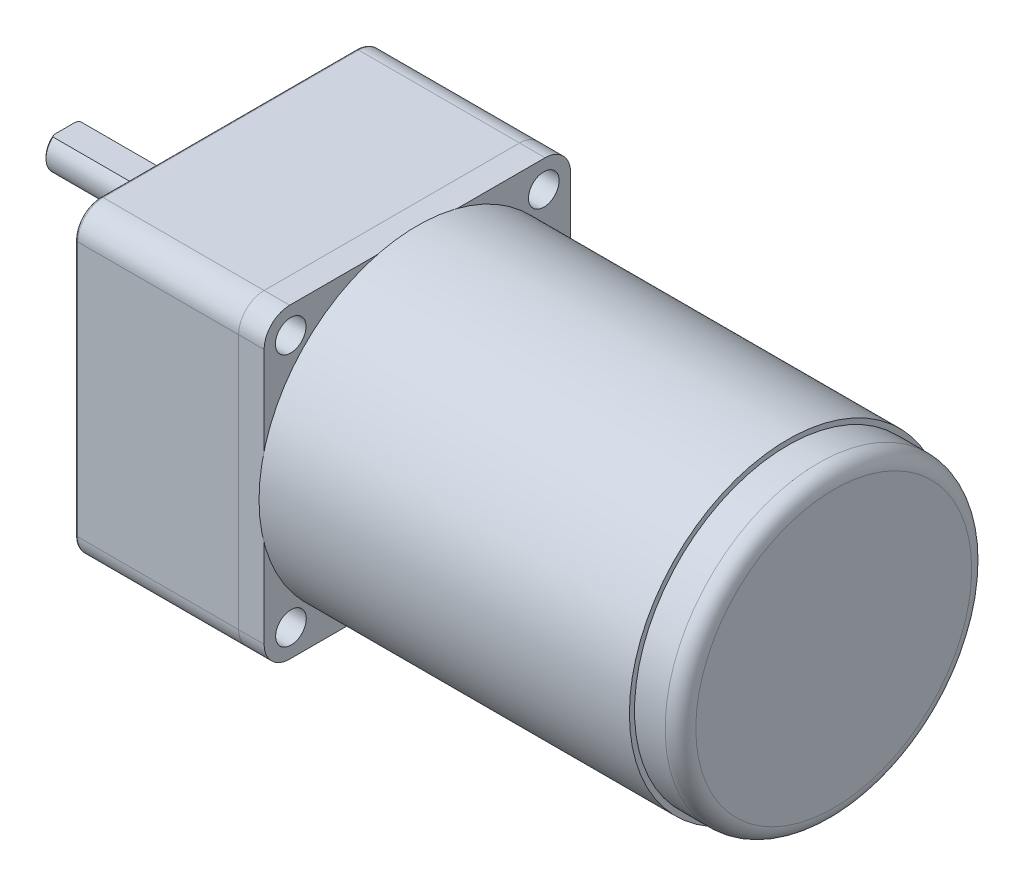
ISO-10303-21;
HEADER;
FILE_DESCRIPTION(('STEP AP214'),'2;1');
FILE_NAME('part.step','',(''),(''),'','','');
FILE_SCHEMA(('AUTOMOTIVE_DESIGN { 1 0 10303 214 1 1 1 1 }'));
ENDSEC;
DATA;
#1=APPLICATION_CONTEXT('core data for automotive mechanical design processes');
#2=APPLICATION_PROTOCOL_DEFINITION('international standard','automotive_design',2000,#1);
#3=PRODUCT_CONTEXT('',#1,'mechanical');
#4=PRODUCT('Part','Part','',(#3));
#5=PRODUCT_RELATED_PRODUCT_CATEGORY('part','',(#4));
#6=PRODUCT_DEFINITION_FORMATION('','',#4);
#7=PRODUCT_DEFINITION_CONTEXT('part definition',#1,'design');
#8=PRODUCT_DEFINITION('design','',#6,#7);
#9=PRODUCT_DEFINITION_SHAPE('','',#8);
#10=(LENGTH_UNIT() NAMED_UNIT(*) SI_UNIT(.MILLI.,.METRE.));
#11=(NAMED_UNIT(*) PLANE_ANGLE_UNIT() SI_UNIT($,.RADIAN.));
#12=(NAMED_UNIT(*) SI_UNIT($,.STERADIAN.) SOLID_ANGLE_UNIT());
#13=UNCERTAINTY_MEASURE_WITH_UNIT(LENGTH_MEASURE(1.E-05),#10,'distance_accuracy_value','');
#14=(GEOMETRIC_REPRESENTATION_CONTEXT(3) GLOBAL_UNCERTAINTY_ASSIGNED_CONTEXT((#13)) GLOBAL_UNIT_ASSIGNED_CONTEXT((#10,
#11,#12)) REPRESENTATION_CONTEXT('',''));
#15=CARTESIAN_POINT('',(0.,0.,0.));
#16=DIRECTION('',(0.,0.,1.));
#17=DIRECTION('',(1.,0.,0.));
#18=AXIS2_PLACEMENT_3D('',#15,#16,#17);
#19=CARTESIAN_POINT('',(118.5,0.,0.));
#20=DIRECTION('',(-1.,0.,0.));
#21=DIRECTION('',(0.,0.,1.));
#22=AXIS2_PLACEMENT_3D('',#19,#20,#21);
#23=CYLINDRICAL_SURFACE('',#22,30.);
#24=CARTESIAN_POINT('',(115.5,0.,0.));
#25=DIRECTION('',(1.,0.,0.));
#26=DIRECTION('',(0.,0.,-1.));
#27=AXIS2_PLACEMENT_3D('',#24,#25,#26);
#28=CIRCLE('',#27,30.);
#29=CARTESIAN_POINT('',(115.5,0.,-30.));
#30=VERTEX_POINT('',#29);
#31=EDGE_CURVE('E11',#30,#30,#28,.F.);
#32=ORIENTED_EDGE('',*,*,#31,.T.);
#33=EDGE_LOOP('',(#32));
#34=FACE_BOUND('',#33,.T.);
#35=CARTESIAN_POINT('',(109.5,0.,0.));
#36=DIRECTION('',(1.,0.,0.));
#37=DIRECTION('',(0.,0.,-1.));
#38=AXIS2_PLACEMENT_3D('',#35,#36,#37);
#39=CIRCLE('',#38,30.);
#40=CARTESIAN_POINT('',(109.5,0.,-30.));
#41=VERTEX_POINT('',#40);
#42=EDGE_CURVE('E55',#41,#41,#39,.T.);
#43=ORIENTED_EDGE('',*,*,#42,.T.);
#44=EDGE_LOOP('',(#43));
#45=FACE_BOUND('',#44,.T.);
#46=ADVANCED_FACE('F44',(#34,#45),#23,.T.);
#47=CARTESIAN_POINT('',(118.5,0.,0.));
#48=DIRECTION('',(1.,0.,0.));
#49=DIRECTION('',(0.,0.,-1.));
#50=AXIS2_PLACEMENT_3D('',#47,#48,#49);
#51=PLANE('',#50);
#52=CARTESIAN_POINT('',(118.5,0.,0.));
#53=DIRECTION('',(1.,0.,0.));
#54=DIRECTION('',(0.,0.,-1.));
#55=AXIS2_PLACEMENT_3D('',#52,#53,#54);
#56=CIRCLE('',#55,27.);
#57=CARTESIAN_POINT('',(118.5,0.,-27.));
#58=VERTEX_POINT('',#57);
#59=EDGE_CURVE('E51',#58,#58,#56,.T.);
#60=ORIENTED_EDGE('',*,*,#59,.T.);
#61=EDGE_LOOP('',(#60));
#62=FACE_BOUND('',#61,.T.);
#63=ADVANCED_FACE('F65',(#62),#51,.T.);
#64=CARTESIAN_POINT('',(109.5,0.,0.));
#65=DIRECTION('',(1.,0.,0.));
#66=DIRECTION('',(0.,0.,-1.));
#67=AXIS2_PLACEMENT_3D('',#64,#65,#66);
#68=PLANE('',#67);
#69=ORIENTED_EDGE('',*,*,#42,.F.);
#70=EDGE_LOOP('',(#69));
#71=FACE_BOUND('',#70,.T.);
#72=ADVANCED_FACE('F63',(#71),#68,.F.);
#73=CARTESIAN_POINT('',(115.5,0.,0.));
#74=DIRECTION('',(1.,0.,0.));
#75=DIRECTION('',(0.,0.,-1.));
#76=AXIS2_PLACEMENT_3D('',#73,#74,#75);
#77=TOROIDAL_SURFACE('',#76,27.,3.);
#78=ORIENTED_EDGE('',*,*,#31,.F.);
#79=EDGE_LOOP('',(#78));
#80=FACE_BOUND('',#79,.T.);
#81=ORIENTED_EDGE('',*,*,#59,.F.);
#82=EDGE_LOOP('',(#81));
#83=FACE_BOUND('',#82,.T.);
#84=ADVANCED_FACE('F46',(#80,#83),#77,.T.);
#85=CLOSED_SHELL('',(#46,#63,#72,#84));
#86=MANIFOLD_SOLID_BREP('B2',#85);
#87=CARTESIAN_POINT('',(109.5,0.,0.));
#88=DIRECTION('',(-1.,0.,0.));
#89=DIRECTION('',(0.,0.,1.));
#90=AXIS2_PLACEMENT_3D('',#87,#88,#89);
#91=CYLINDRICAL_SURFACE('',#90,31.);
#92=CARTESIAN_POINT('',(109.5,0.,0.));
#93=DIRECTION('',(1.,0.,0.));
#94=DIRECTION('',(0.,0.,-1.));
#95=AXIS2_PLACEMENT_3D('',#92,#93,#94);
#96=CIRCLE('',#95,31.);
#97=CARTESIAN_POINT('',(109.5,0.,-31.));
#98=VERTEX_POINT('',#97);
#99=EDGE_CURVE('E43',#98,#98,#96,.T.);
#100=ORIENTED_EDGE('',*,*,#99,.F.);
#101=EDGE_LOOP('',(#100));
#102=FACE_BOUND('',#101,.T.);
#103=CARTESIAN_POINT('',(37.,0.,0.));
#104=DIRECTION('',(1.,0.,0.));
#105=DIRECTION('',(0.,0.,-1.));
#106=AXIS2_PLACEMENT_3D('',#103,#104,#105);
#107=CIRCLE('',#106,31.);
#108=CARTESIAN_POINT('',(37.,0.,-31.));
#109=VERTEX_POINT('',#108);
#110=EDGE_CURVE('E113',#109,#109,#107,.T.);
#111=ORIENTED_EDGE('',*,*,#110,.T.);
#112=EDGE_LOOP('',(#111));
#113=FACE_BOUND('',#112,.T.);
#114=ADVANCED_FACE('F110',(#102,#113),#91,.T.);
#115=CARTESIAN_POINT('',(109.5,0.,0.));
#116=DIRECTION('',(1.,0.,0.));
#117=DIRECTION('',(0.,0.,-1.));
#118=AXIS2_PLACEMENT_3D('',#115,#116,#117);
#119=PLANE('',#118);
#120=ORIENTED_EDGE('',*,*,#99,.T.);
#121=EDGE_LOOP('',(#120));
#122=FACE_BOUND('',#121,.T.);
#123=ADVANCED_FACE('F125',(#122),#119,.T.);
#124=CARTESIAN_POINT('',(37.,0.,0.));
#125=DIRECTION('',(1.,0.,0.));
#126=DIRECTION('',(0.,0.,-1.));
#127=AXIS2_PLACEMENT_3D('',#124,#125,#126);
#128=PLANE('',#127);
#129=ORIENTED_EDGE('',*,*,#110,.F.);
#130=EDGE_LOOP('',(#129));
#131=FACE_BOUND('',#130,.T.);
#132=ADVANCED_FACE('F123',(#131),#128,.F.);
#133=CLOSED_SHELL('',(#114,#123,#132));
#134=MANIFOLD_SOLID_BREP('B6',#133);
#135=CARTESIAN_POINT('',(-32.,10.,0.));
#136=DIRECTION('',(1.,0.,0.));
#137=DIRECTION('',(0.,0.,-1.));
#138=AXIS2_PLACEMENT_3D('',#135,#136,#137);
#139=CYLINDRICAL_SURFACE('',#138,4.);
#140=DIRECTION('',(-1.,0.,0.));
#141=VECTOR('',#140,1.);
#142=CARTESIAN_POINT('',(-7.,13.,2.64575131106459));
#143=LINE('',#142,#141);
#144=CARTESIAN_POINT('',(-7.,13.,2.64575131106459));
#145=VERTEX_POINT('',#144);
#146=CARTESIAN_POINT('',(-31.7,13.,2.64575131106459));
#147=VERTEX_POINT('',#146);
#148=EDGE_CURVE('E202',#145,#147,#143,.T.);
#149=ORIENTED_EDGE('',*,*,#148,.T.);
#150=CARTESIAN_POINT('',(-31.7,10.,0.));
#151=DIRECTION('',(-1.,0.,0.));
#152=DIRECTION('',(0.,0.,1.));
#153=AXIS2_PLACEMENT_3D('',#150,#151,#152);
#154=CIRCLE('',#153,4.);
#155=CARTESIAN_POINT('',(-31.7,13.,-2.64575131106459));
#156=VERTEX_POINT('',#155);
#157=EDGE_CURVE('E108',#147,#156,#154,.F.);
#158=ORIENTED_EDGE('',*,*,#157,.T.);
#159=DIRECTION('',(-1.,0.,0.));
#160=VECTOR('',#159,1.);
#161=CARTESIAN_POINT('',(-7.,13.,-2.64575131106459));
#162=LINE('',#161,#160);
#163=CARTESIAN_POINT('',(-7.,13.,-2.64575131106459));
#164=VERTEX_POINT('',#163);
#165=EDGE_CURVE('E200',#164,#156,#162,.T.);
#166=ORIENTED_EDGE('',*,*,#165,.F.);
#167=CARTESIAN_POINT('',(-7.,10.,0.));
#168=DIRECTION('',(-1.,0.,0.));
#169=DIRECTION('',(0.,0.,1.));
#170=AXIS2_PLACEMENT_3D('',#167,#168,#169);
#171=CIRCLE('',#170,4.);
#172=EDGE_CURVE('E193',#145,#164,#171,.T.);
#173=ORIENTED_EDGE('',*,*,#172,.F.);
#174=EDGE_LOOP('',(#149,#158,#166,#173));
#175=FACE_BOUND('',#174,.T.);
#176=CARTESIAN_POINT('',(-3.,10.,0.));
#177=DIRECTION('',(-1.,0.,0.));
#178=DIRECTION('',(0.,0.,1.));
#179=AXIS2_PLACEMENT_3D('',#176,#177,#178);
#180=CIRCLE('',#179,4.);
#181=CARTESIAN_POINT('',(-3.,10.,4.));
#182=VERTEX_POINT('',#181);
#183=EDGE_CURVE('E206',#182,#182,#180,.T.);
#184=ORIENTED_EDGE('',*,*,#183,.T.);
#185=EDGE_LOOP('',(#184));
#186=FACE_BOUND('',#185,.T.);
#187=ADVANCED_FACE('F159',(#175,#186),#139,.T.);
#188=CARTESIAN_POINT('',(-32.,10.,0.));
#189=DIRECTION('',(-1.,0.,0.));
#190=DIRECTION('',(0.,0.,1.));
#191=AXIS2_PLACEMENT_3D('',#188,#189,#190);
#192=PLANE('',#191);
#193=DIRECTION('',(0.,0.,1.));
#194=VECTOR('',#193,1.);
#195=CARTESIAN_POINT('',(-32.,13.,2.64575131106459));
#196=LINE('',#195,#194);
#197=CARTESIAN_POINT('',(-32.,13.,-2.16564078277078));
#198=VERTEX_POINT('',#197);
#199=CARTESIAN_POINT('',(-32.,13.,2.16564078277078));
#200=VERTEX_POINT('',#199);
#201=EDGE_CURVE('E197',#198,#200,#196,.T.);
#202=ORIENTED_EDGE('',*,*,#201,.F.);
#203=CARTESIAN_POINT('',(-32.,10.,0.));
#204=DIRECTION('',(-1.,0.,0.));
#205=DIRECTION('',(0.,0.,1.));
#206=AXIS2_PLACEMENT_3D('',#203,#204,#205);
#207=CIRCLE('',#206,3.70000000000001);
#208=EDGE_CURVE('E212',#198,#200,#207,.T.);
#209=ORIENTED_EDGE('',*,*,#208,.T.);
#210=EDGE_LOOP('',(#202,#209));
#211=FACE_BOUND('',#210,.T.);
#212=ADVANCED_FACE('F228',(#211),#192,.T.);
#213=CARTESIAN_POINT('',(-3.,10.,0.));
#214=DIRECTION('',(-1.,0.,0.));
#215=DIRECTION('',(0.,0.,1.));
#216=AXIS2_PLACEMENT_3D('',#213,#214,#215);
#217=PLANE('',#216);
#218=ORIENTED_EDGE('',*,*,#183,.F.);
#219=EDGE_LOOP('',(#218));
#220=FACE_BOUND('',#219,.T.);
#221=ADVANCED_FACE('F227',(#220),#217,.F.);
#222=CARTESIAN_POINT('',(-7.,13.,2.64575131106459));
#223=DIRECTION('',(0.,-1.,0.));
#224=DIRECTION('',(0.,0.,-1.));
#225=AXIS2_PLACEMENT_3D('',#222,#223,#224);
#226=PLANE('',#225);
#227=ORIENTED_EDGE('',*,*,#201,.T.);
#228=CARTESIAN_POINT('',(-32.,13.,2.16564078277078));
#229=CARTESIAN_POINT('',(-31.9761619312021,13.,2.20636622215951));
#230=CARTESIAN_POINT('',(-31.95199678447,13.,2.2468991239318));
#231=CARTESIAN_POINT('',(-31.9030718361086,13.,2.32759423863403));
#232=CARTESIAN_POINT('',(-31.8783121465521,13.,2.36775651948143));
#233=CARTESIAN_POINT('',(-31.8282492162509,13.,2.44773910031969));
#234=CARTESIAN_POINT('',(-31.80294598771,13.,2.48755940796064));
#235=CARTESIAN_POINT('',(-31.7518371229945,13.,2.56688695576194));
#236=CARTESIAN_POINT('',(-31.7260313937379,13.,2.60639413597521));
#237=CARTESIAN_POINT('',(-31.7000000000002,13.,2.64575131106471));
#238=B_SPLINE_CURVE_WITH_KNOTS('',3,(#228,#229,#230,#231,#232,#233,#234,#235,#236,#237),
.UNSPECIFIED.,.F.,.F.,(4,2,2,2,4),(0.,0.141564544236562,0.28310260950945,0.424637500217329,
0.566198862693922),.UNSPECIFIED.);
#239=EDGE_CURVE('E168',#200,#147,#238,.T.);
#240=ORIENTED_EDGE('',*,*,#239,.T.);
#241=ORIENTED_EDGE('',*,*,#148,.F.);
#242=DIRECTION('',(0.,0.,1.));
#243=VECTOR('',#242,1.);
#244=CARTESIAN_POINT('',(-7.,13.,2.64575131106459));
#245=LINE('',#244,#243);
#246=EDGE_CURVE('E196',#164,#145,#245,.T.);
#247=ORIENTED_EDGE('',*,*,#246,.F.);
#248=ORIENTED_EDGE('',*,*,#165,.T.);
#249=CARTESIAN_POINT('',(-31.7,13.,-2.64575131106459));
#250=CARTESIAN_POINT('',(-31.7260313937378,13.,-2.60639413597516));
#251=CARTESIAN_POINT('',(-31.7518371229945,13.,-2.56688695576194));
#252=CARTESIAN_POINT('',(-31.80294598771,13.,-2.48755940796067));
#253=CARTESIAN_POINT('',(-31.8282492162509,13.,-2.44773910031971));
#254=CARTESIAN_POINT('',(-31.878312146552,13.,-2.36775651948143));
#255=CARTESIAN_POINT('',(-31.9030718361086,13.,-2.32759423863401));
#256=CARTESIAN_POINT('',(-31.9519967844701,13.,-2.24689912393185));
#257=CARTESIAN_POINT('',(-31.9761619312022,13.,-2.20636622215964));
#258=CARTESIAN_POINT('',(-32.0000000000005,13.,-2.16564078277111));
#259=B_SPLINE_CURVE_WITH_KNOTS('',3,(#249,#250,#251,#252,#253,#254,#255,#256,#257,#258),
.UNSPECIFIED.,.F.,.F.,(4,2,2,2,4),(0.,0.141561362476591,0.283096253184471,0.424634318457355,
0.566198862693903),.UNSPECIFIED.);
#260=EDGE_CURVE('E215',#156,#198,#259,.T.);
#261=ORIENTED_EDGE('',*,*,#260,.T.);
#262=EDGE_LOOP('',(#227,#240,#241,#247,#248,#261));
#263=FACE_BOUND('',#262,.T.);
#264=ADVANCED_FACE('F199',(#263),#226,.F.);
#265=CARTESIAN_POINT('',(-7.,10.,0.));
#266=DIRECTION('',(-1.,0.,0.));
#267=DIRECTION('',(0.,0.,1.));
#268=AXIS2_PLACEMENT_3D('',#265,#266,#267);
#269=PLANE('',#268);
#270=ORIENTED_EDGE('',*,*,#172,.T.);
#271=ORIENTED_EDGE('',*,*,#246,.T.);
#272=EDGE_LOOP('',(#270,#271));
#273=FACE_BOUND('',#272,.T.);
#274=ADVANCED_FACE('F195',(#273),#269,.T.);
#275=CARTESIAN_POINT('',(-32.,10.,0.));
#276=DIRECTION('',(1.,0.,0.));
#277=DIRECTION('',(0.,0.,-1.));
#278=AXIS2_PLACEMENT_3D('',#275,#276,#277);
#279=CONICAL_SURFACE('',#278,3.70000000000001,0.785398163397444);
#280=ORIENTED_EDGE('',*,*,#260,.F.);
#281=ORIENTED_EDGE('',*,*,#157,.F.);
#282=ORIENTED_EDGE('',*,*,#239,.F.);
#283=ORIENTED_EDGE('',*,*,#208,.F.);
#284=EDGE_LOOP('',(#280,#281,#282,#283));
#285=FACE_BOUND('',#284,.T.);
#286=ADVANCED_FACE('F161',(#285),#279,.T.);
#287=CLOSED_SHELL('',(#187,#212,#221,#264,#274,#286));
#288=MANIFOLD_SOLID_BREP('B38',#287);
#289=CARTESIAN_POINT('',(-3.,10.,0.));
#290=DIRECTION('',(1.,0.,0.));
#291=DIRECTION('',(0.,0.,-1.));
#292=AXIS2_PLACEMENT_3D('',#289,#290,#291);
#293=CYLINDRICAL_SURFACE('',#292,12.);
#294=CARTESIAN_POINT('',(-2.5,10.,0.));
#295=DIRECTION('',(-1.,0.,0.));
#296=DIRECTION('',(0.,0.,1.));
#297=AXIS2_PLACEMENT_3D('',#294,#295,#296);
#298=CIRCLE('',#297,12.);
#299=CARTESIAN_POINT('',(-2.5,10.,12.));
#300=VERTEX_POINT('',#299);
#301=EDGE_CURVE('E158',#300,#300,#298,.F.);
#302=ORIENTED_EDGE('',*,*,#301,.T.);
#303=EDGE_LOOP('',(#302));
#304=FACE_BOUND('',#303,.T.);
#305=CARTESIAN_POINT('',(0.,10.,0.));
#306=DIRECTION('',(-1.,0.,0.));
#307=DIRECTION('',(0.,0.,1.));
#308=AXIS2_PLACEMENT_3D('',#305,#306,#307);
#309=CIRCLE('',#308,12.);
#310=CARTESIAN_POINT('',(0.,10.,12.));
#311=VERTEX_POINT('',#310);
#312=EDGE_CURVE('E303',#311,#311,#309,.T.);
#313=ORIENTED_EDGE('',*,*,#312,.T.);
#314=EDGE_LOOP('',(#313));
#315=FACE_BOUND('',#314,.T.);
#316=ADVANCED_FACE('F292',(#304,#315),#293,.T.);
#317=CARTESIAN_POINT('',(-3.,10.,0.));
#318=DIRECTION('',(-1.,0.,0.));
#319=DIRECTION('',(0.,0.,1.));
#320=AXIS2_PLACEMENT_3D('',#317,#318,#319);
#321=PLANE('',#320);
#322=CARTESIAN_POINT('',(-3.,10.,0.));
#323=DIRECTION('',(-1.,0.,0.));
#324=DIRECTION('',(0.,0.,1.));
#325=AXIS2_PLACEMENT_3D('',#322,#323,#324);
#326=CIRCLE('',#325,11.5);
#327=CARTESIAN_POINT('',(-3.,10.,11.5));
#328=VERTEX_POINT('',#327);
#329=EDGE_CURVE('E299',#328,#328,#326,.T.);
#330=ORIENTED_EDGE('',*,*,#329,.T.);
#331=EDGE_LOOP('',(#330));
#332=FACE_BOUND('',#331,.T.);
#333=ADVANCED_FACE('F313',(#332),#321,.T.);
#334=CARTESIAN_POINT('',(0.,10.,0.));
#335=DIRECTION('',(-1.,0.,0.));
#336=DIRECTION('',(0.,0.,1.));
#337=AXIS2_PLACEMENT_3D('',#334,#335,#336);
#338=PLANE('',#337);
#339=ORIENTED_EDGE('',*,*,#312,.F.);
#340=EDGE_LOOP('',(#339));
#341=FACE_BOUND('',#340,.T.);
#342=ADVANCED_FACE('F311',(#341),#338,.F.);
#343=CARTESIAN_POINT('',(-2.5,10.,0.));
#344=DIRECTION('',(-1.,0.,0.));
#345=DIRECTION('',(0.,0.,1.));
#346=AXIS2_PLACEMENT_3D('',#343,#344,#345);
#347=TOROIDAL_SURFACE('',#346,11.5,0.5);
#348=ORIENTED_EDGE('',*,*,#301,.F.);
#349=EDGE_LOOP('',(#348));
#350=FACE_BOUND('',#349,.T.);
#351=ORIENTED_EDGE('',*,*,#329,.F.);
#352=EDGE_LOOP('',(#351));
#353=FACE_BOUND('',#352,.T.);
#354=ADVANCED_FACE('F294',(#350,#353),#347,.T.);
#355=CLOSED_SHELL('',(#316,#333,#342,#354));
#356=MANIFOLD_SOLID_BREP('B102',#355);
#357=CARTESIAN_POINT('',(37.,25.,-25.));
#358=DIRECTION('',(-1.,0.,0.));
#359=DIRECTION('',(0.,0.,1.));
#360=AXIS2_PLACEMENT_3D('',#357,#358,#359);
#361=CYLINDRICAL_SURFACE('',#360,5.);
#362=CARTESIAN_POINT('',(32.,25.,-25.));
#363=DIRECTION('',(1.,0.,0.));
#364=DIRECTION('',(0.,0.,1.));
#365=AXIS2_PLACEMENT_3D('',#362,#363,#364);
#366=CIRCLE('',#365,5.);
#367=CARTESIAN_POINT('',(32.,25.,-30.));
#368=VERTEX_POINT('',#367);
#369=CARTESIAN_POINT('',(32.,30.,-25.));
#370=VERTEX_POINT('',#369);
#371=EDGE_CURVE('E455',#368,#370,#366,.T.);
#372=ORIENTED_EDGE('',*,*,#371,.T.);
#373=DIRECTION('',(-1.,0.,0.));
#374=VECTOR('',#373,1.);
#375=CARTESIAN_POINT('',(37.,30.,-25.));
#376=LINE('',#375,#374);
#377=CARTESIAN_POINT('',(37.,30.,-25.));
#378=VERTEX_POINT('',#377);
#379=EDGE_CURVE('E290',#378,#370,#376,.T.);
#380=ORIENTED_EDGE('',*,*,#379,.F.);
#381=CARTESIAN_POINT('',(37.,25.,-25.));
#382=DIRECTION('',(1.,0.,0.));
#383=DIRECTION('',(0.,0.,1.));
#384=AXIS2_PLACEMENT_3D('',#381,#382,#383);
#385=CIRCLE('',#384,5.);
#386=CARTESIAN_POINT('',(37.,25.,-30.));
#387=VERTEX_POINT('',#386);
#388=EDGE_CURVE('E469',#387,#378,#385,.T.);
#389=ORIENTED_EDGE('',*,*,#388,.F.);
#390=DIRECTION('',(-1.,0.,0.));
#391=VECTOR('',#390,1.);
#392=CARTESIAN_POINT('',(37.,25.,-30.));
#393=LINE('',#392,#391);
#394=EDGE_CURVE('E451',#387,#368,#393,.T.);
#395=ORIENTED_EDGE('',*,*,#394,.T.);
#396=EDGE_LOOP('',(#372,#380,#389,#395));
#397=FACE_BOUND('',#396,.T.);
#398=ADVANCED_FACE('F357',(#397),#361,.T.);
#399=CARTESIAN_POINT('',(37.,30.,25.));
#400=DIRECTION('',(0.,-1.,0.));
#401=DIRECTION('',(0.,0.,-1.));
#402=AXIS2_PLACEMENT_3D('',#399,#400,#401);
#403=PLANE('',#402);
#404=DIRECTION('',(0.,0.,1.));
#405=VECTOR('',#404,1.);
#406=CARTESIAN_POINT('',(32.,30.,25.));
#407=LINE('',#406,#405);
#408=CARTESIAN_POINT('',(32.,30.,25.));
#409=VERTEX_POINT('',#408);
#410=EDGE_CURVE('E458',#370,#409,#407,.T.);
#411=ORIENTED_EDGE('',*,*,#410,.T.);
#412=DIRECTION('',(-1.,0.,0.));
#413=VECTOR('',#412,1.);
#414=CARTESIAN_POINT('',(37.,30.,25.));
#415=LINE('',#414,#413);
#416=CARTESIAN_POINT('',(37.,30.,25.));
#417=VERTEX_POINT('',#416);
#418=EDGE_CURVE('E366',#417,#409,#415,.T.);
#419=ORIENTED_EDGE('',*,*,#418,.F.);
#420=DIRECTION('',(0.,0.,1.));
#421=VECTOR('',#420,1.);
#422=CARTESIAN_POINT('',(37.,30.,25.));
#423=LINE('',#422,#421);
#424=EDGE_CURVE('E418',#378,#417,#423,.T.);
#425=ORIENTED_EDGE('',*,*,#424,.F.);
#426=ORIENTED_EDGE('',*,*,#379,.T.);
#427=EDGE_LOOP('',(#411,#419,#425,#426));
#428=FACE_BOUND('',#427,.T.);
#429=ADVANCED_FACE('F523',(#428),#403,.F.);
#430=CARTESIAN_POINT('',(37.,25.,25.));
#431=DIRECTION('',(-1.,0.,0.));
#432=DIRECTION('',(0.,0.,1.));
#433=AXIS2_PLACEMENT_3D('',#430,#431,#432);
#434=CYLINDRICAL_SURFACE('',#433,5.);
#435=CARTESIAN_POINT('',(32.,25.,25.));
#436=DIRECTION('',(1.,0.,0.));
#437=DIRECTION('',(0.,0.,1.));
#438=AXIS2_PLACEMENT_3D('',#435,#436,#437);
#439=CIRCLE('',#438,5.);
#440=CARTESIAN_POINT('',(32.,25.,30.));
#441=VERTEX_POINT('',#440);
#442=EDGE_CURVE('E460',#409,#441,#439,.T.);
#443=ORIENTED_EDGE('',*,*,#442,.T.);
#444=DIRECTION('',(-1.,0.,0.));
#445=VECTOR('',#444,1.);
#446=CARTESIAN_POINT('',(37.,25.,30.));
#447=LINE('',#446,#445);
#448=CARTESIAN_POINT('',(37.,25.,30.));
#449=VERTEX_POINT('',#448);
#450=EDGE_CURVE('E476',#449,#441,#447,.T.);
#451=ORIENTED_EDGE('',*,*,#450,.F.);
#452=CARTESIAN_POINT('',(37.,25.,25.));
#453=DIRECTION('',(1.,0.,0.));
#454=DIRECTION('',(0.,0.,1.));
#455=AXIS2_PLACEMENT_3D('',#452,#453,#454);
#456=CIRCLE('',#455,5.);
#457=EDGE_CURVE('E624',#417,#449,#456,.T.);
#458=ORIENTED_EDGE('',*,*,#457,.F.);
#459=ORIENTED_EDGE('',*,*,#418,.T.);
#460=EDGE_LOOP('',(#443,#451,#458,#459));
#461=FACE_BOUND('',#460,.T.);
#462=ADVANCED_FACE('F527',(#461),#434,.T.);
#463=CARTESIAN_POINT('',(37.,-25.,30.));
#464=DIRECTION('',(0.,0.,-1.));
#465=DIRECTION('',(-1.,0.,0.));
#466=AXIS2_PLACEMENT_3D('',#463,#464,#465);
#467=PLANE('',#466);
#468=DIRECTION('',(0.,-1.,0.));
#469=VECTOR('',#468,1.);
#470=CARTESIAN_POINT('',(32.,-25.,30.));
#471=LINE('',#470,#469);
#472=CARTESIAN_POINT('',(32.,-25.,30.));
#473=VERTEX_POINT('',#472);
#474=EDGE_CURVE('E462',#441,#473,#471,.T.);
#475=ORIENTED_EDGE('',*,*,#474,.T.);
#476=DIRECTION('',(-1.,0.,0.));
#477=VECTOR('',#476,1.);
#478=CARTESIAN_POINT('',(37.,-25.,30.));
#479=LINE('',#478,#477);
#480=CARTESIAN_POINT('',(37.,-25.,30.));
#481=VERTEX_POINT('',#480);
#482=EDGE_CURVE('E473',#481,#473,#479,.T.);
#483=ORIENTED_EDGE('',*,*,#482,.F.);
#484=DIRECTION('',(0.,-1.,0.));
#485=VECTOR('',#484,1.);
#486=CARTESIAN_POINT('',(37.,-25.,30.));
#487=LINE('',#486,#485);
#488=EDGE_CURVE('E626',#449,#481,#487,.T.);
#489=ORIENTED_EDGE('',*,*,#488,.F.);
#490=ORIENTED_EDGE('',*,*,#450,.T.);
#491=EDGE_LOOP('',(#475,#483,#489,#490));
#492=FACE_BOUND('',#491,.T.);
#493=ADVANCED_FACE('F531',(#492),#467,.F.);
#494=CARTESIAN_POINT('',(37.,-25.,25.));
#495=DIRECTION('',(-1.,0.,0.));
#496=DIRECTION('',(0.,0.,1.));
#497=AXIS2_PLACEMENT_3D('',#494,#495,#496);
#498=CYLINDRICAL_SURFACE('',#497,5.);
#499=CARTESIAN_POINT('',(32.,-25.,25.));
#500=DIRECTION('',(1.,0.,0.));
#501=DIRECTION('',(0.,0.,1.));
#502=AXIS2_PLACEMENT_3D('',#499,#500,#501);
#503=CIRCLE('',#502,5.);
#504=CARTESIAN_POINT('',(32.,-30.,25.));
#505=VERTEX_POINT('',#504);
#506=EDGE_CURVE('E464',#473,#505,#503,.T.);
#507=ORIENTED_EDGE('',*,*,#506,.T.);
#508=DIRECTION('',(-1.,0.,0.));
#509=VECTOR('',#508,1.);
#510=CARTESIAN_POINT('',(37.,-30.,25.));
#511=LINE('',#510,#509);
#512=CARTESIAN_POINT('',(37.,-30.,25.));
#513=VERTEX_POINT('',#512);
#514=EDGE_CURVE('E446',#513,#505,#511,.T.);
#515=ORIENTED_EDGE('',*,*,#514,.F.);
#516=CARTESIAN_POINT('',(37.,-25.,25.));
#517=DIRECTION('',(1.,0.,0.));
#518=DIRECTION('',(0.,0.,1.));
#519=AXIS2_PLACEMENT_3D('',#516,#517,#518);
#520=CIRCLE('',#519,5.);
#521=EDGE_CURVE('E437',#481,#513,#520,.T.);
#522=ORIENTED_EDGE('',*,*,#521,.F.);
#523=ORIENTED_EDGE('',*,*,#482,.T.);
#524=EDGE_LOOP('',(#507,#515,#522,#523));
#525=FACE_BOUND('',#524,.T.);
#526=ADVANCED_FACE('F537',(#525),#498,.T.);
#527=CARTESIAN_POINT('',(37.,-30.,25.));
#528=DIRECTION('',(0.,1.,0.));
#529=DIRECTION('',(0.,0.,1.));
#530=AXIS2_PLACEMENT_3D('',#527,#528,#529);
#531=PLANE('',#530);
#532=DIRECTION('',(0.,0.,-1.));
#533=VECTOR('',#532,1.);
#534=CARTESIAN_POINT('',(32.,-30.,25.));
#535=LINE('',#534,#533);
#536=CARTESIAN_POINT('',(32.,-30.,-25.));
#537=VERTEX_POINT('',#536);
#538=EDGE_CURVE('E445',#505,#537,#535,.T.);
#539=ORIENTED_EDGE('',*,*,#538,.T.);
#540=DIRECTION('',(-1.,0.,0.));
#541=VECTOR('',#540,1.);
#542=CARTESIAN_POINT('',(37.,-30.,-25.));
#543=LINE('',#542,#541);
#544=CARTESIAN_POINT('',(37.,-30.,-25.));
#545=VERTEX_POINT('',#544);
#546=EDGE_CURVE('E442',#545,#537,#543,.T.);
#547=ORIENTED_EDGE('',*,*,#546,.F.);
#548=DIRECTION('',(0.,0.,-1.));
#549=VECTOR('',#548,1.);
#550=CARTESIAN_POINT('',(37.,-30.,25.));
#551=LINE('',#550,#549);
#552=EDGE_CURVE('E431',#513,#545,#551,.T.);
#553=ORIENTED_EDGE('',*,*,#552,.F.);
#554=ORIENTED_EDGE('',*,*,#514,.T.);
#555=EDGE_LOOP('',(#539,#547,#553,#554));
#556=FACE_BOUND('',#555,.T.);
#557=ADVANCED_FACE('F443',(#556),#531,.F.);
#558=CARTESIAN_POINT('',(37.,-25.,-25.));
#559=DIRECTION('',(-1.,0.,0.));
#560=DIRECTION('',(0.,0.,1.));
#561=AXIS2_PLACEMENT_3D('',#558,#559,#560);
#562=CYLINDRICAL_SURFACE('',#561,5.);
#563=CARTESIAN_POINT('',(32.,-25.,-25.));
#564=DIRECTION('',(1.,0.,0.));
#565=DIRECTION('',(0.,0.,-1.));
#566=AXIS2_PLACEMENT_3D('',#563,#564,#565);
#567=CIRCLE('',#566,5.);
#568=CARTESIAN_POINT('',(32.,-25.,-30.));
#569=VERTEX_POINT('',#568);
#570=EDGE_CURVE('E404',#537,#569,#567,.T.);
#571=ORIENTED_EDGE('',*,*,#570,.T.);
#572=DIRECTION('',(-1.,0.,0.));
#573=VECTOR('',#572,1.);
#574=CARTESIAN_POINT('',(37.,-25.,-30.));
#575=LINE('',#574,#573);
#576=CARTESIAN_POINT('',(37.,-25.,-30.));
#577=VERTEX_POINT('',#576);
#578=EDGE_CURVE('E447',#577,#569,#575,.T.);
#579=ORIENTED_EDGE('',*,*,#578,.F.);
#580=CARTESIAN_POINT('',(37.,-25.,-25.));
#581=DIRECTION('',(1.,0.,0.));
#582=DIRECTION('',(0.,0.,-1.));
#583=AXIS2_PLACEMENT_3D('',#580,#581,#582);
#584=CIRCLE('',#583,5.);
#585=EDGE_CURVE('E435',#545,#577,#584,.T.);
#586=ORIENTED_EDGE('',*,*,#585,.F.);
#587=ORIENTED_EDGE('',*,*,#546,.T.);
#588=EDGE_LOOP('',(#571,#579,#586,#587));
#589=FACE_BOUND('',#588,.T.);
#590=ADVANCED_FACE('F449',(#589),#562,.T.);
#591=CARTESIAN_POINT('',(37.,-25.,-30.));
#592=DIRECTION('',(0.,0.,1.));
#593=DIRECTION('',(1.,0.,0.));
#594=AXIS2_PLACEMENT_3D('',#591,#592,#593);
#595=PLANE('',#594);
#596=DIRECTION('',(0.,1.,0.));
#597=VECTOR('',#596,1.);
#598=CARTESIAN_POINT('',(32.,-25.,-30.));
#599=LINE('',#598,#597);
#600=EDGE_CURVE('E410',#569,#368,#599,.T.);
#601=ORIENTED_EDGE('',*,*,#600,.T.);
#602=ORIENTED_EDGE('',*,*,#394,.F.);
#603=DIRECTION('',(0.,1.,0.));
#604=VECTOR('',#603,1.);
#605=CARTESIAN_POINT('',(37.,-25.,-30.));
#606=LINE('',#605,#604);
#607=EDGE_CURVE('E375',#577,#387,#606,.T.);
#608=ORIENTED_EDGE('',*,*,#607,.F.);
#609=ORIENTED_EDGE('',*,*,#578,.T.);
#610=EDGE_LOOP('',(#601,#602,#608,#609));
#611=FACE_BOUND('',#610,.T.);
#612=ADVANCED_FACE('F512',(#611),#595,.F.);
#613=CARTESIAN_POINT('',(37.,25.,-25.));
#614=DIRECTION('',(-1.,0.,0.));
#615=DIRECTION('',(0.,0.,1.));
#616=AXIS2_PLACEMENT_3D('',#613,#614,#615);
#617=PLANE('',#616);
#618=CARTESIAN_POINT('',(37.,24.8007290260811,24.8007290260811));
#619=DIRECTION('',(1.,0.,0.));
#620=DIRECTION('',(0.,0.,-1.));
#621=AXIS2_PLACEMENT_3D('',#618,#619,#620);
#622=CIRCLE('',#621,3.);
#623=CARTESIAN_POINT('',(37.,24.8007290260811,21.8007290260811));
#624=VERTEX_POINT('',#623);
#625=EDGE_CURVE('E485',#624,#624,#622,.T.);
#626=ORIENTED_EDGE('',*,*,#625,.F.);
#627=EDGE_LOOP('',(#626));
#628=FACE_BOUND('',#627,.T.);
#629=CARTESIAN_POINT('',(37.,24.7487373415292,-24.7487373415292));
#630=DIRECTION('',(1.,0.,0.));
#631=DIRECTION('',(0.,0.,-1.));
#632=AXIS2_PLACEMENT_3D('',#629,#630,#631);
#633=CIRCLE('',#632,3.);
#634=CARTESIAN_POINT('',(37.,24.7487373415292,-27.7487373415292));
#635=VERTEX_POINT('',#634);
#636=EDGE_CURVE('E610',#635,#635,#633,.T.);
#637=ORIENTED_EDGE('',*,*,#636,.F.);
#638=EDGE_LOOP('',(#637));
#639=FACE_BOUND('',#638,.T.);
#640=CARTESIAN_POINT('',(37.,-24.7487373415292,-24.7487373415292));
#641=DIRECTION('',(1.,0.,0.));
#642=DIRECTION('',(0.,0.,-1.));
#643=AXIS2_PLACEMENT_3D('',#640,#641,#642);
#644=CIRCLE('',#643,3.);
#645=CARTESIAN_POINT('',(37.,-24.7487373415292,-27.7487373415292));
#646=VERTEX_POINT('',#645);
#647=EDGE_CURVE('E612',#646,#646,#644,.T.);
#648=ORIENTED_EDGE('',*,*,#647,.F.);
#649=EDGE_LOOP('',(#648));
#650=FACE_BOUND('',#649,.T.);
#651=CARTESIAN_POINT('',(37.,-24.7487373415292,24.7487373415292));
#652=DIRECTION('',(1.,0.,0.));
#653=DIRECTION('',(0.,0.,-1.));
#654=AXIS2_PLACEMENT_3D('',#651,#652,#653);
#655=CIRCLE('',#654,3.);
#656=CARTESIAN_POINT('',(37.,-24.7487373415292,21.7487373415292));
#657=VERTEX_POINT('',#656);
#658=EDGE_CURVE('E617',#657,#657,#655,.T.);
#659=ORIENTED_EDGE('',*,*,#658,.F.);
#660=EDGE_LOOP('',(#659));
#661=FACE_BOUND('',#660,.T.);
#662=ORIENTED_EDGE('',*,*,#388,.T.);
#663=ORIENTED_EDGE('',*,*,#424,.T.);
#664=ORIENTED_EDGE('',*,*,#457,.T.);
#665=ORIENTED_EDGE('',*,*,#488,.T.);
#666=ORIENTED_EDGE('',*,*,#521,.T.);
#667=ORIENTED_EDGE('',*,*,#552,.T.);
#668=ORIENTED_EDGE('',*,*,#585,.T.);
#669=ORIENTED_EDGE('',*,*,#607,.T.);
#670=EDGE_LOOP('',(#662,#663,#664,#665,#666,#667,#668,#669));
#671=FACE_BOUND('',#670,.T.);
#672=ADVANCED_FACE('F433',(#628,#639,#650,#661,#671),#617,.F.);
#673=CARTESIAN_POINT('',(32.,25.,-25.));
#674=DIRECTION('',(-1.,0.,0.));
#675=DIRECTION('',(0.,0.,1.));
#676=AXIS2_PLACEMENT_3D('',#673,#674,#675);
#677=PLANE('',#676);
#678=CARTESIAN_POINT('',(32.,24.8007290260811,24.8007290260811));
#679=DIRECTION('',(-1.,0.,0.));
#680=DIRECTION('',(0.,0.,1.));
#681=AXIS2_PLACEMENT_3D('',#678,#679,#680);
#682=CIRCLE('',#681,3.);
#683=CARTESIAN_POINT('',(32.,24.8007290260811,27.8007290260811));
#684=VERTEX_POINT('',#683);
#685=EDGE_CURVE('E360',#684,#684,#682,.T.);
#686=ORIENTED_EDGE('',*,*,#685,.F.);
#687=EDGE_LOOP('',(#686));
#688=FACE_BOUND('',#687,.T.);
#689=CARTESIAN_POINT('',(32.,24.7487373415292,-24.7487373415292));
#690=DIRECTION('',(-1.,0.,0.));
#691=DIRECTION('',(0.,0.,1.));
#692=AXIS2_PLACEMENT_3D('',#689,#690,#691);
#693=CIRCLE('',#692,3.);
#694=CARTESIAN_POINT('',(32.,24.7487373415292,-21.7487373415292));
#695=VERTEX_POINT('',#694);
#696=EDGE_CURVE('E487',#695,#695,#693,.T.);
#697=ORIENTED_EDGE('',*,*,#696,.F.);
#698=EDGE_LOOP('',(#697));
#699=FACE_BOUND('',#698,.T.);
#700=CARTESIAN_POINT('',(32.,-24.7487373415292,-24.7487373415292));
#701=DIRECTION('',(-1.,0.,0.));
#702=DIRECTION('',(0.,0.,1.));
#703=AXIS2_PLACEMENT_3D('',#700,#701,#702);
#704=CIRCLE('',#703,3.);
#705=CARTESIAN_POINT('',(32.,-24.7487373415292,-21.7487373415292));
#706=VERTEX_POINT('',#705);
#707=EDGE_CURVE('E484',#706,#706,#704,.T.);
#708=ORIENTED_EDGE('',*,*,#707,.F.);
#709=EDGE_LOOP('',(#708));
#710=FACE_BOUND('',#709,.T.);
#711=CARTESIAN_POINT('',(32.,-24.7487373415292,24.7487373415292));
#712=DIRECTION('',(-1.,0.,0.));
#713=DIRECTION('',(0.,0.,1.));
#714=AXIS2_PLACEMENT_3D('',#711,#712,#713);
#715=CIRCLE('',#714,3.);
#716=CARTESIAN_POINT('',(32.,-24.7487373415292,27.7487373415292));
#717=VERTEX_POINT('',#716);
#718=EDGE_CURVE('E481',#717,#717,#715,.T.);
#719=ORIENTED_EDGE('',*,*,#718,.F.);
#720=EDGE_LOOP('',(#719));
#721=FACE_BOUND('',#720,.T.);
#722=ORIENTED_EDGE('',*,*,#371,.F.);
#723=ORIENTED_EDGE('',*,*,#600,.F.);
#724=ORIENTED_EDGE('',*,*,#570,.F.);
#725=ORIENTED_EDGE('',*,*,#538,.F.);
#726=ORIENTED_EDGE('',*,*,#506,.F.);
#727=ORIENTED_EDGE('',*,*,#474,.F.);
#728=ORIENTED_EDGE('',*,*,#442,.F.);
#729=ORIENTED_EDGE('',*,*,#410,.F.);
#730=EDGE_LOOP('',(#722,#723,#724,#725,#726,#727,#728,#729));
#731=FACE_BOUND('',#730,.T.);
#732=ADVANCED_FACE('F497',(#688,#699,#710,#721,#731),#677,.T.);
#733=CARTESIAN_POINT('',(12.,-24.7487373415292,24.7487373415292));
#734=DIRECTION('',(1.,0.,0.));
#735=DIRECTION('',(0.,0.,-1.));
#736=AXIS2_PLACEMENT_3D('',#733,#734,#735);
#737=CYLINDRICAL_SURFACE('',#736,3.);
#738=ORIENTED_EDGE('',*,*,#718,.T.);
#739=EDGE_LOOP('',(#738));
#740=FACE_BOUND('',#739,.T.);
#741=ORIENTED_EDGE('',*,*,#658,.T.);
#742=EDGE_LOOP('',(#741));
#743=FACE_BOUND('',#742,.T.);
#744=ADVANCED_FACE('F500',(#740,#743),#737,.F.);
#745=CARTESIAN_POINT('',(12.,-24.7487373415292,-24.7487373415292));
#746=DIRECTION('',(1.,0.,0.));
#747=DIRECTION('',(0.,0.,-1.));
#748=AXIS2_PLACEMENT_3D('',#745,#746,#747);
#749=CYLINDRICAL_SURFACE('',#748,3.);
#750=ORIENTED_EDGE('',*,*,#707,.T.);
#751=EDGE_LOOP('',(#750));
#752=FACE_BOUND('',#751,.T.);
#753=ORIENTED_EDGE('',*,*,#647,.T.);
#754=EDGE_LOOP('',(#753));
#755=FACE_BOUND('',#754,.T.);
#756=ADVANCED_FACE('F576',(#752,#755),#749,.F.);
#757=CARTESIAN_POINT('',(12.,24.7487373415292,-24.7487373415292));
#758=DIRECTION('',(1.,0.,0.));
#759=DIRECTION('',(0.,0.,-1.));
#760=AXIS2_PLACEMENT_3D('',#757,#758,#759);
#761=CYLINDRICAL_SURFACE('',#760,3.);
#762=ORIENTED_EDGE('',*,*,#696,.T.);
#763=EDGE_LOOP('',(#762));
#764=FACE_BOUND('',#763,.T.);
#765=ORIENTED_EDGE('',*,*,#636,.T.);
#766=EDGE_LOOP('',(#765));
#767=FACE_BOUND('',#766,.T.);
#768=ADVANCED_FACE('F586',(#764,#767),#761,.F.);
#769=CARTESIAN_POINT('',(12.,24.8007290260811,24.8007290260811));
#770=DIRECTION('',(1.,0.,0.));
#771=DIRECTION('',(0.,0.,-1.));
#772=AXIS2_PLACEMENT_3D('',#769,#770,#771);
#773=CYLINDRICAL_SURFACE('',#772,3.);
#774=ORIENTED_EDGE('',*,*,#685,.T.);
#775=EDGE_LOOP('',(#774));
#776=FACE_BOUND('',#775,.T.);
#777=ORIENTED_EDGE('',*,*,#625,.T.);
#778=EDGE_LOOP('',(#777));
#779=FACE_BOUND('',#778,.T.);
#780=ADVANCED_FACE('F494',(#776,#779),#773,.F.);
#781=CLOSED_SHELL('',(#398,#429,#462,#493,#526,#557,#590,#612,#672,#732,#744,#756,#768,#780));
#782=MANIFOLD_SOLID_BREP('B153',#781);
#783=CARTESIAN_POINT('',(32.,-25.,25.));
#784=DIRECTION('',(-1.,0.,0.));
#785=DIRECTION('',(0.,0.,1.));
#786=AXIS2_PLACEMENT_3D('',#783,#784,#785);
#787=CYLINDRICAL_SURFACE('',#786,5.);
#788=DIRECTION('',(-1.,0.,0.));
#789=VECTOR('',#788,1.);
#790=CARTESIAN_POINT('',(32.,-25.,30.));
#791=LINE('',#790,#789);
#792=CARTESIAN_POINT('',(32.,-25.,30.));
#793=VERTEX_POINT('',#792);
#794=CARTESIAN_POINT('',(0.5,-25.,30.));
#795=VERTEX_POINT('',#794);
#796=EDGE_CURVE('E884',#793,#795,#791,.T.);
#797=ORIENTED_EDGE('',*,*,#796,.T.);
#798=CARTESIAN_POINT('',(0.5,-25.,25.));
#799=DIRECTION('',(-1.,0.,0.));
#800=DIRECTION('',(0.,0.,1.));
#801=AXIS2_PLACEMENT_3D('',#798,#799,#800);
#802=CIRCLE('',#801,5.);
#803=CARTESIAN_POINT('',(0.5,-30.,25.));
#804=VERTEX_POINT('',#803);
#805=EDGE_CURVE('E355',#795,#804,#802,.F.);
#806=ORIENTED_EDGE('',*,*,#805,.T.);
#807=DIRECTION('',(-1.,0.,0.));
#808=VECTOR('',#807,1.);
#809=CARTESIAN_POINT('',(32.,-30.,25.));
#810=LINE('',#809,#808);
#811=CARTESIAN_POINT('',(32.,-30.,25.));
#812=VERTEX_POINT('',#811);
#813=EDGE_CURVE('E766',#812,#804,#810,.T.);
#814=ORIENTED_EDGE('',*,*,#813,.F.);
#815=CARTESIAN_POINT('',(32.,-25.,25.));
#816=DIRECTION('',(1.,0.,0.));
#817=DIRECTION('',(0.,0.,1.));
#818=AXIS2_PLACEMENT_3D('',#815,#816,#817);
#819=CIRCLE('',#818,5.);
#820=EDGE_CURVE('E773',#793,#812,#819,.T.);
#821=ORIENTED_EDGE('',*,*,#820,.F.);
#822=EDGE_LOOP('',(#797,#806,#814,#821));
#823=FACE_BOUND('',#822,.T.);
#824=ADVANCED_FACE('F669',(#823),#787,.T.);
#825=CARTESIAN_POINT('',(32.,-30.,25.));
#826=DIRECTION('',(0.,1.,0.));
#827=DIRECTION('',(0.,0.,1.));
#828=AXIS2_PLACEMENT_3D('',#825,#826,#827);
#829=PLANE('',#828);
#830=ORIENTED_EDGE('',*,*,#813,.T.);
#831=DIRECTION('',(0.,0.,-1.));
#832=VECTOR('',#831,1.);
#833=CARTESIAN_POINT('',(0.5,-30.,-25.));
#834=LINE('',#833,#832);
#835=CARTESIAN_POINT('',(0.5,-30.,-25.));
#836=VERTEX_POINT('',#835);
#837=EDGE_CURVE('E786',#804,#836,#834,.T.);
#838=ORIENTED_EDGE('',*,*,#837,.T.);
#839=DIRECTION('',(-1.,0.,0.));
#840=VECTOR('',#839,1.);
#841=CARTESIAN_POINT('',(32.,-30.,-25.));
#842=LINE('',#841,#840);
#843=CARTESIAN_POINT('',(32.,-30.,-25.));
#844=VERTEX_POINT('',#843);
#845=EDGE_CURVE('E769',#844,#836,#842,.T.);
#846=ORIENTED_EDGE('',*,*,#845,.F.);
#847=DIRECTION('',(0.,0.,-1.));
#848=VECTOR('',#847,1.);
#849=CARTESIAN_POINT('',(32.,-30.,25.));
#850=LINE('',#849,#848);
#851=EDGE_CURVE('E761',#812,#844,#850,.T.);
#852=ORIENTED_EDGE('',*,*,#851,.F.);
#853=EDGE_LOOP('',(#830,#838,#846,#852));
#854=FACE_BOUND('',#853,.T.);
#855=ADVANCED_FACE('F763',(#854),#829,.F.);
#856=CARTESIAN_POINT('',(32.,-25.,-25.));
#857=DIRECTION('',(-1.,0.,0.));
#858=DIRECTION('',(0.,0.,1.));
#859=AXIS2_PLACEMENT_3D('',#856,#857,#858);
#860=CYLINDRICAL_SURFACE('',#859,5.);
#861=ORIENTED_EDGE('',*,*,#845,.T.);
#862=CARTESIAN_POINT('',(0.5,-25.,-25.));
#863=DIRECTION('',(-1.,0.,0.));
#864=DIRECTION('',(0.,0.,1.));
#865=AXIS2_PLACEMENT_3D('',#862,#863,#864);
#866=CIRCLE('',#865,5.);
#867=CARTESIAN_POINT('',(0.5,-25.,-30.));
#868=VERTEX_POINT('',#867);
#869=EDGE_CURVE('E810',#836,#868,#866,.F.);
#870=ORIENTED_EDGE('',*,*,#869,.T.);
#871=DIRECTION('',(-1.,0.,0.));
#872=VECTOR('',#871,1.);
#873=CARTESIAN_POINT('',(32.,-25.,-30.));
#874=LINE('',#873,#872);
#875=CARTESIAN_POINT('',(32.,-25.,-30.));
#876=VERTEX_POINT('',#875);
#877=EDGE_CURVE('E788',#876,#868,#874,.T.);
#878=ORIENTED_EDGE('',*,*,#877,.F.);
#879=CARTESIAN_POINT('',(32.,-25.,-25.));
#880=DIRECTION('',(1.,0.,0.));
#881=DIRECTION('',(0.,0.,-1.));
#882=AXIS2_PLACEMENT_3D('',#879,#880,#881);
#883=CIRCLE('',#882,5.);
#884=EDGE_CURVE('E772',#844,#876,#883,.T.);
#885=ORIENTED_EDGE('',*,*,#884,.F.);
#886=EDGE_LOOP('',(#861,#870,#878,#885));
#887=FACE_BOUND('',#886,.T.);
#888=ADVANCED_FACE('F949',(#887),#860,.T.);
#889=CARTESIAN_POINT('',(32.,-25.,-30.));
#890=DIRECTION('',(0.,0.,1.));
#891=DIRECTION('',(1.,0.,0.));
#892=AXIS2_PLACEMENT_3D('',#889,#890,#891);
#893=PLANE('',#892);
#894=ORIENTED_EDGE('',*,*,#877,.T.);
#895=DIRECTION('',(0.,1.,0.));
#896=VECTOR('',#895,1.);
#897=CARTESIAN_POINT('',(0.5,25.,-30.));
#898=LINE('',#897,#896);
#899=CARTESIAN_POINT('',(0.5,25.,-30.));
#900=VERTEX_POINT('',#899);
#901=EDGE_CURVE('E812',#868,#900,#898,.T.);
#902=ORIENTED_EDGE('',*,*,#901,.T.);
#903=DIRECTION('',(-1.,0.,0.));
#904=VECTOR('',#903,1.);
#905=CARTESIAN_POINT('',(32.,25.,-30.));
#906=LINE('',#905,#904);
#907=CARTESIAN_POINT('',(32.,25.,-30.));
#908=VERTEX_POINT('',#907);
#909=EDGE_CURVE('E893',#908,#900,#906,.T.);
#910=ORIENTED_EDGE('',*,*,#909,.F.);
#911=DIRECTION('',(0.,1.,0.));
#912=VECTOR('',#911,1.);
#913=CARTESIAN_POINT('',(32.,-25.,-30.));
#914=LINE('',#913,#912);
#915=EDGE_CURVE('E875',#876,#908,#914,.T.);
#916=ORIENTED_EDGE('',*,*,#915,.F.);
#917=EDGE_LOOP('',(#894,#902,#910,#916));
#918=FACE_BOUND('',#917,.T.);
#919=ADVANCED_FACE('F900',(#918),#893,.F.);
#920=CARTESIAN_POINT('',(32.,25.,-25.));
#921=DIRECTION('',(-1.,0.,0.));
#922=DIRECTION('',(0.,0.,1.));
#923=AXIS2_PLACEMENT_3D('',#920,#921,#922);
#924=CYLINDRICAL_SURFACE('',#923,5.);
#925=ORIENTED_EDGE('',*,*,#909,.T.);
#926=CARTESIAN_POINT('',(0.5,25.,-25.));
#927=DIRECTION('',(-1.,0.,0.));
#928=DIRECTION('',(0.,0.,1.));
#929=AXIS2_PLACEMENT_3D('',#926,#927,#928);
#930=CIRCLE('',#929,5.);
#931=CARTESIAN_POINT('',(0.5,30.,-25.));
#932=VERTEX_POINT('',#931);
#933=EDGE_CURVE('E814',#900,#932,#930,.F.);
#934=ORIENTED_EDGE('',*,*,#933,.T.);
#935=DIRECTION('',(-1.,0.,0.));
#936=VECTOR('',#935,1.);
#937=CARTESIAN_POINT('',(32.,30.,-25.));
#938=LINE('',#937,#936);
#939=CARTESIAN_POINT('',(32.,30.,-25.));
#940=VERTEX_POINT('',#939);
#941=EDGE_CURVE('E890',#940,#932,#938,.T.);
#942=ORIENTED_EDGE('',*,*,#941,.F.);
#943=CARTESIAN_POINT('',(32.,25.,-25.));
#944=DIRECTION('',(1.,0.,0.));
#945=DIRECTION('',(0.,0.,1.));
#946=AXIS2_PLACEMENT_3D('',#943,#944,#945);
#947=CIRCLE('',#946,5.);
#948=EDGE_CURVE('E877',#908,#940,#947,.T.);
#949=ORIENTED_EDGE('',*,*,#948,.F.);
#950=EDGE_LOOP('',(#925,#934,#942,#949));
#951=FACE_BOUND('',#950,.T.);
#952=ADVANCED_FACE('F942',(#951),#924,.T.);
#953=CARTESIAN_POINT('',(32.,30.,25.));
#954=DIRECTION('',(0.,-1.,0.));
#955=DIRECTION('',(0.,0.,-1.));
#956=AXIS2_PLACEMENT_3D('',#953,#954,#955);
#957=PLANE('',#956);
#958=ORIENTED_EDGE('',*,*,#941,.T.);
#959=DIRECTION('',(0.,0.,1.));
#960=VECTOR('',#959,1.);
#961=CARTESIAN_POINT('',(0.5,30.,25.));
#962=LINE('',#961,#960);
#963=CARTESIAN_POINT('',(0.5,30.,25.));
#964=VERTEX_POINT('',#963);
#965=EDGE_CURVE('E816',#932,#964,#962,.T.);
#966=ORIENTED_EDGE('',*,*,#965,.T.);
#967=DIRECTION('',(-1.,0.,0.));
#968=VECTOR('',#967,1.);
#969=CARTESIAN_POINT('',(32.,30.,25.));
#970=LINE('',#969,#968);
#971=CARTESIAN_POINT('',(32.,30.,25.));
#972=VERTEX_POINT('',#971);
#973=EDGE_CURVE('E888',#972,#964,#970,.T.);
#974=ORIENTED_EDGE('',*,*,#973,.F.);
#975=DIRECTION('',(0.,0.,1.));
#976=VECTOR('',#975,1.);
#977=CARTESIAN_POINT('',(32.,30.,25.));
#978=LINE('',#977,#976);
#979=EDGE_CURVE('E879',#940,#972,#978,.T.);
#980=ORIENTED_EDGE('',*,*,#979,.F.);
#981=EDGE_LOOP('',(#958,#966,#974,#980));
#982=FACE_BOUND('',#981,.T.);
#983=ADVANCED_FACE('F946',(#982),#957,.F.);
#984=CARTESIAN_POINT('',(32.,25.,25.));
#985=DIRECTION('',(-1.,0.,0.));
#986=DIRECTION('',(0.,0.,1.));
#987=AXIS2_PLACEMENT_3D('',#984,#985,#986);
#988=CYLINDRICAL_SURFACE('',#987,5.);
#989=ORIENTED_EDGE('',*,*,#973,.T.);
#990=CARTESIAN_POINT('',(0.5,25.,25.));
#991=DIRECTION('',(-1.,0.,0.));
#992=DIRECTION('',(0.,0.,1.));
#993=AXIS2_PLACEMENT_3D('',#990,#991,#992);
#994=CIRCLE('',#993,5.);
#995=CARTESIAN_POINT('',(0.5,25.,30.));
#996=VERTEX_POINT('',#995);
#997=EDGE_CURVE('E693',#964,#996,#994,.F.);
#998=ORIENTED_EDGE('',*,*,#997,.T.);
#999=DIRECTION('',(-1.,0.,0.));
#1000=VECTOR('',#999,1.);
#1001=CARTESIAN_POINT('',(32.,25.,30.));
#1002=LINE('',#1001,#1000);
#1003=CARTESIAN_POINT('',(32.,25.,30.));
#1004=VERTEX_POINT('',#1003);
#1005=EDGE_CURVE('E886',#1004,#996,#1002,.T.);
#1006=ORIENTED_EDGE('',*,*,#1005,.F.);
#1007=CARTESIAN_POINT('',(32.,25.,25.));
#1008=DIRECTION('',(1.,0.,0.));
#1009=DIRECTION('',(0.,0.,1.));
#1010=AXIS2_PLACEMENT_3D('',#1007,#1008,#1009);
#1011=CIRCLE('',#1010,5.);
#1012=EDGE_CURVE('E881',#972,#1004,#1011,.T.);
#1013=ORIENTED_EDGE('',*,*,#1012,.F.);
#1014=EDGE_LOOP('',(#989,#998,#1006,#1013));
#1015=FACE_BOUND('',#1014,.T.);
#1016=ADVANCED_FACE('F1021',(#1015),#988,.T.);
#1017=CARTESIAN_POINT('',(32.,-25.,30.));
#1018=DIRECTION('',(0.,0.,-1.));
#1019=DIRECTION('',(-1.,0.,0.));
#1020=AXIS2_PLACEMENT_3D('',#1017,#1018,#1019);
#1021=PLANE('',#1020);
#1022=ORIENTED_EDGE('',*,*,#1005,.T.);
#1023=DIRECTION('',(0.,-1.,0.));
#1024=VECTOR('',#1023,1.);
#1025=CARTESIAN_POINT('',(0.5,-25.,30.));
#1026=LINE('',#1025,#1024);
#1027=EDGE_CURVE('E678',#996,#795,#1026,.T.);
#1028=ORIENTED_EDGE('',*,*,#1027,.T.);
#1029=ORIENTED_EDGE('',*,*,#796,.F.);
#1030=DIRECTION('',(0.,-1.,0.));
#1031=VECTOR('',#1030,1.);
#1032=CARTESIAN_POINT('',(32.,-25.,30.));
#1033=LINE('',#1032,#1031);
#1034=EDGE_CURVE('E778',#1004,#793,#1033,.T.);
#1035=ORIENTED_EDGE('',*,*,#1034,.F.);
#1036=EDGE_LOOP('',(#1022,#1028,#1029,#1035));
#1037=FACE_BOUND('',#1036,.T.);
#1038=ADVANCED_FACE('F1013',(#1037),#1021,.F.);
#1039=CARTESIAN_POINT('',(32.,-25.,25.));
#1040=DIRECTION('',(-1.,0.,0.));
#1041=DIRECTION('',(0.,0.,1.));
#1042=AXIS2_PLACEMENT_3D('',#1039,#1040,#1041);
#1043=PLANE('',#1042);
#1044=CARTESIAN_POINT('',(32.,24.8007290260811,24.8007290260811));
#1045=DIRECTION('',(-1.,0.,0.));
#1046=DIRECTION('',(0.,0.,1.));
#1047=AXIS2_PLACEMENT_3D('',#1044,#1045,#1046);
#1048=CIRCLE('',#1047,3.);
#1049=CARTESIAN_POINT('',(32.,24.8007290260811,27.8007290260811));
#1050=VERTEX_POINT('',#1049);
#1051=EDGE_CURVE('E673',#1050,#1050,#1048,.T.);
#1052=ORIENTED_EDGE('',*,*,#1051,.T.);
#1053=EDGE_LOOP('',(#1052));
#1054=FACE_BOUND('',#1053,.T.);
#1055=CARTESIAN_POINT('',(32.,24.7487373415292,-24.7487373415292));
#1056=DIRECTION('',(-1.,0.,0.));
#1057=DIRECTION('',(0.,0.,1.));
#1058=AXIS2_PLACEMENT_3D('',#1055,#1056,#1057);
#1059=CIRCLE('',#1058,3.);
#1060=CARTESIAN_POINT('',(32.,24.7487373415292,-21.7487373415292));
#1061=VERTEX_POINT('',#1060);
#1062=EDGE_CURVE('E849',#1061,#1061,#1059,.T.);
#1063=ORIENTED_EDGE('',*,*,#1062,.T.);
#1064=EDGE_LOOP('',(#1063));
#1065=FACE_BOUND('',#1064,.T.);
#1066=CARTESIAN_POINT('',(32.,-24.7487373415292,-24.7487373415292));
#1067=DIRECTION('',(-1.,0.,0.));
#1068=DIRECTION('',(0.,0.,1.));
#1069=AXIS2_PLACEMENT_3D('',#1066,#1067,#1068);
#1070=CIRCLE('',#1069,3.);
#1071=CARTESIAN_POINT('',(32.,-24.7487373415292,-21.7487373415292));
#1072=VERTEX_POINT('',#1071);
#1073=EDGE_CURVE('E846',#1072,#1072,#1070,.T.);
#1074=ORIENTED_EDGE('',*,*,#1073,.T.);
#1075=EDGE_LOOP('',(#1074));
#1076=FACE_BOUND('',#1075,.T.);
#1077=CARTESIAN_POINT('',(32.,-24.7487373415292,24.7487373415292));
#1078=DIRECTION('',(-1.,0.,0.));
#1079=DIRECTION('',(0.,0.,1.));
#1080=AXIS2_PLACEMENT_3D('',#1077,#1078,#1079);
#1081=CIRCLE('',#1080,3.);
#1082=CARTESIAN_POINT('',(32.,-24.7487373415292,27.7487373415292));
#1083=VERTEX_POINT('',#1082);
#1084=EDGE_CURVE('E843',#1083,#1083,#1081,.T.);
#1085=ORIENTED_EDGE('',*,*,#1084,.T.);
#1086=EDGE_LOOP('',(#1085));
#1087=FACE_BOUND('',#1086,.T.);
#1088=ORIENTED_EDGE('',*,*,#820,.T.);
#1089=ORIENTED_EDGE('',*,*,#851,.T.);
#1090=ORIENTED_EDGE('',*,*,#884,.T.);
#1091=ORIENTED_EDGE('',*,*,#915,.T.);
#1092=ORIENTED_EDGE('',*,*,#948,.T.);
#1093=ORIENTED_EDGE('',*,*,#979,.T.);
#1094=ORIENTED_EDGE('',*,*,#1012,.T.);
#1095=ORIENTED_EDGE('',*,*,#1034,.T.);
#1096=EDGE_LOOP('',(#1088,#1089,#1090,#1091,#1092,#1093,#1094,#1095));
#1097=FACE_BOUND('',#1096,.T.);
#1098=ADVANCED_FACE('F776',(#1054,#1065,#1076,#1087,#1097),#1043,.F.);
#1099=CARTESIAN_POINT('',(0.,-25.,25.));
#1100=DIRECTION('',(-1.,0.,0.));
#1101=DIRECTION('',(0.,0.,1.));
#1102=AXIS2_PLACEMENT_3D('',#1099,#1100,#1101);
#1103=PLANE('',#1102);
#1104=CARTESIAN_POINT('',(0.,24.7487373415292,-24.7487373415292));
#1105=DIRECTION('',(-1.,0.,0.));
#1106=DIRECTION('',(0.,0.,1.));
#1107=AXIS2_PLACEMENT_3D('',#1104,#1105,#1106);
#1108=CIRCLE('',#1107,1.65);
#1109=CARTESIAN_POINT('',(0.,24.7487373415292,-23.0987373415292));
#1110=VERTEX_POINT('',#1109);
#1111=EDGE_CURVE('E854',#1110,#1110,#1108,.T.);
#1112=ORIENTED_EDGE('',*,*,#1111,.F.);
#1113=EDGE_LOOP('',(#1112));
#1114=FACE_BOUND('',#1113,.T.);
#1115=CARTESIAN_POINT('',(0.,24.7487373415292,24.7487373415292));
#1116=DIRECTION('',(-1.,0.,0.));
#1117=DIRECTION('',(0.,0.,1.));
#1118=AXIS2_PLACEMENT_3D('',#1115,#1116,#1117);
#1119=CIRCLE('',#1118,1.65);
#1120=CARTESIAN_POINT('',(0.,24.7487373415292,26.3987373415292));
#1121=VERTEX_POINT('',#1120);
#1122=EDGE_CURVE('E858',#1121,#1121,#1119,.T.);
#1123=ORIENTED_EDGE('',*,*,#1122,.F.);
#1124=EDGE_LOOP('',(#1123));
#1125=FACE_BOUND('',#1124,.T.);
#1126=CARTESIAN_POINT('',(0.,-24.7487373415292,24.7487373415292));
#1127=DIRECTION('',(-1.,0.,0.));
#1128=DIRECTION('',(0.,0.,1.));
#1129=AXIS2_PLACEMENT_3D('',#1126,#1127,#1128);
#1130=CIRCLE('',#1129,1.65);
#1131=CARTESIAN_POINT('',(0.,-24.7487373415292,26.3987373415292));
#1132=VERTEX_POINT('',#1131);
#1133=EDGE_CURVE('E863',#1132,#1132,#1130,.T.);
#1134=ORIENTED_EDGE('',*,*,#1133,.F.);
#1135=EDGE_LOOP('',(#1134));
#1136=FACE_BOUND('',#1135,.T.);
#1137=CARTESIAN_POINT('',(0.,-24.7487373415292,-24.7487373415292));
#1138=DIRECTION('',(-1.,0.,0.));
#1139=DIRECTION('',(0.,0.,1.));
#1140=AXIS2_PLACEMENT_3D('',#1137,#1138,#1139);
#1141=CIRCLE('',#1140,1.65);
#1142=CARTESIAN_POINT('',(0.,-24.7487373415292,-23.0987373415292));
#1143=VERTEX_POINT('',#1142);
#1144=EDGE_CURVE('E823',#1143,#1143,#1141,.T.);
#1145=ORIENTED_EDGE('',*,*,#1144,.F.);
#1146=EDGE_LOOP('',(#1145));
#1147=FACE_BOUND('',#1146,.T.);
#1148=CARTESIAN_POINT('',(0.,-25.,-25.));
#1149=DIRECTION('',(-1.,0.,0.));
#1150=DIRECTION('',(0.,0.,1.));
#1151=AXIS2_PLACEMENT_3D('',#1148,#1149,#1150);
#1152=CIRCLE('',#1151,4.5);
#1153=CARTESIAN_POINT('',(0.,-25.,-29.5));
#1154=VERTEX_POINT('',#1153);
#1155=CARTESIAN_POINT('',(0.,-29.5,-25.));
#1156=VERTEX_POINT('',#1155);
#1157=EDGE_CURVE('E805',#1154,#1156,#1152,.T.);
#1158=ORIENTED_EDGE('',*,*,#1157,.T.);
#1159=DIRECTION('',(0.,0.,-1.));
#1160=VECTOR('',#1159,1.);
#1161=CARTESIAN_POINT('',(0.,-29.5,25.));
#1162=LINE('',#1161,#1160);
#1163=CARTESIAN_POINT('',(0.,-29.5,25.));
#1164=VERTEX_POINT('',#1163);
#1165=EDGE_CURVE('E807',#1156,#1164,#1162,.F.);
#1166=ORIENTED_EDGE('',*,*,#1165,.T.);
#1167=CARTESIAN_POINT('',(0.,-25.,25.));
#1168=DIRECTION('',(-1.,0.,0.));
#1169=DIRECTION('',(0.,0.,1.));
#1170=AXIS2_PLACEMENT_3D('',#1167,#1168,#1169);
#1171=CIRCLE('',#1170,4.5);
#1172=CARTESIAN_POINT('',(0.,-25.,29.5));
#1173=VERTEX_POINT('',#1172);
#1174=EDGE_CURVE('E793',#1164,#1173,#1171,.T.);
#1175=ORIENTED_EDGE('',*,*,#1174,.T.);
#1176=DIRECTION('',(0.,-1.,0.));
#1177=VECTOR('',#1176,1.);
#1178=CARTESIAN_POINT('',(0.,25.,29.5));
#1179=LINE('',#1178,#1177);
#1180=CARTESIAN_POINT('',(0.,25.,29.5));
#1181=VERTEX_POINT('',#1180);
#1182=EDGE_CURVE('E795',#1173,#1181,#1179,.F.);
#1183=ORIENTED_EDGE('',*,*,#1182,.T.);
#1184=CARTESIAN_POINT('',(0.,25.,25.));
#1185=DIRECTION('',(-1.,0.,0.));
#1186=DIRECTION('',(0.,0.,1.));
#1187=AXIS2_PLACEMENT_3D('',#1184,#1185,#1186);
#1188=CIRCLE('',#1187,4.5);
#1189=CARTESIAN_POINT('',(0.,29.5,25.));
#1190=VERTEX_POINT('',#1189);
#1191=EDGE_CURVE('E797',#1181,#1190,#1188,.T.);
#1192=ORIENTED_EDGE('',*,*,#1191,.T.);
#1193=DIRECTION('',(0.,0.,1.));
#1194=VECTOR('',#1193,1.);
#1195=CARTESIAN_POINT('',(0.,29.5,-25.));
#1196=LINE('',#1195,#1194);
#1197=CARTESIAN_POINT('',(0.,29.5,-25.));
#1198=VERTEX_POINT('',#1197);
#1199=EDGE_CURVE('E799',#1190,#1198,#1196,.F.);
#1200=ORIENTED_EDGE('',*,*,#1199,.T.);
#1201=CARTESIAN_POINT('',(0.,25.,-25.));
#1202=DIRECTION('',(-1.,0.,0.));
#1203=DIRECTION('',(0.,0.,1.));
#1204=AXIS2_PLACEMENT_3D('',#1201,#1202,#1203);
#1205=CIRCLE('',#1204,4.5);
#1206=CARTESIAN_POINT('',(0.,25.,-29.5));
#1207=VERTEX_POINT('',#1206);
#1208=EDGE_CURVE('E801',#1198,#1207,#1205,.T.);
#1209=ORIENTED_EDGE('',*,*,#1208,.T.);
#1210=DIRECTION('',(0.,1.,0.));
#1211=VECTOR('',#1210,1.);
#1212=CARTESIAN_POINT('',(0.,-25.,-29.5));
#1213=LINE('',#1212,#1211);
#1214=EDGE_CURVE('E803',#1207,#1154,#1213,.F.);
#1215=ORIENTED_EDGE('',*,*,#1214,.T.);
#1216=EDGE_LOOP('',(#1158,#1166,#1175,#1183,#1192,#1200,#1209,#1215));
#1217=FACE_BOUND('',#1216,.T.);
#1218=CARTESIAN_POINT('',(0.,0.,0.));
#1219=DIRECTION('',(-1.,0.,0.));
#1220=DIRECTION('',(0.,0.,1.));
#1221=AXIS2_PLACEMENT_3D('',#1218,#1219,#1220);
#1222=CIRCLE('',#1221,26.8);
#1223=CARTESIAN_POINT('',(0.,0.,26.8));
#1224=VERTEX_POINT('',#1223);
#1225=EDGE_CURVE('E783',#1224,#1224,#1222,.F.);
#1226=ORIENTED_EDGE('',*,*,#1225,.T.);
#1227=EDGE_LOOP('',(#1226));
#1228=FACE_BOUND('',#1227,.T.);
#1229=ADVANCED_FACE('F915',(#1114,#1125,#1136,#1147,#1217,#1228),#1103,.T.);
#1230=CARTESIAN_POINT('',(0.5,0.,0.));
#1231=DIRECTION('',(-1.,0.,0.));
#1232=DIRECTION('',(0.,0.,1.));
#1233=AXIS2_PLACEMENT_3D('',#1230,#1231,#1232);
#1234=PLANE('',#1233);
#1235=CARTESIAN_POINT('',(0.5,0.,0.));
#1236=DIRECTION('',(-1.,0.,0.));
#1237=DIRECTION('',(0.,0.,1.));
#1238=AXIS2_PLACEMENT_3D('',#1235,#1236,#1237);
#1239=CIRCLE('',#1238,26.3);
#1240=CARTESIAN_POINT('',(0.5,0.,26.3));
#1241=VERTEX_POINT('',#1240);
#1242=EDGE_CURVE('E780',#1241,#1241,#1239,.T.);
#1243=ORIENTED_EDGE('',*,*,#1242,.T.);
#1244=EDGE_LOOP('',(#1243));
#1245=FACE_BOUND('',#1244,.T.);
#1246=ADVANCED_FACE('F966',(#1245),#1234,.T.);
#1247=CARTESIAN_POINT('',(0.5,0.,0.));
#1248=DIRECTION('',(-1.,0.,0.));
#1249=DIRECTION('',(0.,0.,1.));
#1250=AXIS2_PLACEMENT_3D('',#1247,#1248,#1249);
#1251=TOROIDAL_SURFACE('',#1250,26.8,0.5);
#1252=ORIENTED_EDGE('',*,*,#1225,.F.);
#1253=EDGE_LOOP('',(#1252));
#1254=FACE_BOUND('',#1253,.T.);
#1255=ORIENTED_EDGE('',*,*,#1242,.F.);
#1256=EDGE_LOOP('',(#1255));
#1257=FACE_BOUND('',#1256,.T.);
#1258=ADVANCED_FACE('F963',(#1254,#1257),#1251,.T.);
#1259=CARTESIAN_POINT('',(0.5,29.5,25.));
#1260=DIRECTION('',(0.,0.,-1.));
#1261=DIRECTION('',(-1.,0.,0.));
#1262=AXIS2_PLACEMENT_3D('',#1259,#1260,#1261);
#1263=CYLINDRICAL_SURFACE('',#1262,0.5);
#1264=CARTESIAN_POINT('',(0.5,29.5,-25.));
#1265=DIRECTION('',(0.,0.,-1.));
#1266=DIRECTION('',(0.,1.,0.));
#1267=AXIS2_PLACEMENT_3D('',#1264,#1265,#1266);
#1268=CIRCLE('',#1267,0.5);
#1269=EDGE_CURVE('E837',#1198,#932,#1268,.T.);
#1270=ORIENTED_EDGE('',*,*,#1269,.F.);
#1271=ORIENTED_EDGE('',*,*,#1199,.F.);
#1272=CARTESIAN_POINT('',(0.5,29.5,25.));
#1273=DIRECTION('',(0.,0.,1.));
#1274=DIRECTION('',(1.,0.,0.));
#1275=AXIS2_PLACEMENT_3D('',#1272,#1273,#1274);
#1276=CIRCLE('',#1275,0.5);
#1277=EDGE_CURVE('E840',#964,#1190,#1276,.T.);
#1278=ORIENTED_EDGE('',*,*,#1277,.F.);
#1279=ORIENTED_EDGE('',*,*,#965,.F.);
#1280=EDGE_LOOP('',(#1270,#1271,#1278,#1279));
#1281=FACE_BOUND('',#1280,.T.);
#1282=ADVANCED_FACE('F671',(#1281),#1263,.T.);
#1283=CARTESIAN_POINT('',(0.5,25.,25.));
#1284=DIRECTION('',(-1.,0.,0.));
#1285=DIRECTION('',(0.,0.,1.));
#1286=AXIS2_PLACEMENT_3D('',#1283,#1284,#1285);
#1287=TOROIDAL_SURFACE('',#1286,4.5,0.5);
#1288=ORIENTED_EDGE('',*,*,#1277,.T.);
#1289=ORIENTED_EDGE('',*,*,#1191,.F.);
#1290=CARTESIAN_POINT('',(0.5,25.,29.5));
#1291=DIRECTION('',(0.,-1.,0.));
#1292=DIRECTION('',(0.,0.,-1.));
#1293=AXIS2_PLACEMENT_3D('',#1290,#1291,#1292);
#1294=CIRCLE('',#1293,0.5);
#1295=EDGE_CURVE('E834',#996,#1181,#1294,.T.);
#1296=ORIENTED_EDGE('',*,*,#1295,.F.);
#1297=ORIENTED_EDGE('',*,*,#997,.F.);
#1298=EDGE_LOOP('',(#1288,#1289,#1296,#1297));
#1299=FACE_BOUND('',#1298,.T.);
#1300=ADVANCED_FACE('F930',(#1299),#1287,.T.);
#1301=CARTESIAN_POINT('',(0.5,25.,-25.));
#1302=DIRECTION('',(-1.,0.,0.));
#1303=DIRECTION('',(0.,0.,1.));
#1304=AXIS2_PLACEMENT_3D('',#1301,#1302,#1303);
#1305=TOROIDAL_SURFACE('',#1304,4.5,0.5);
#1306=ORIENTED_EDGE('',*,*,#1269,.T.);
#1307=ORIENTED_EDGE('',*,*,#933,.F.);
#1308=CARTESIAN_POINT('',(0.5,25.,-29.5));
#1309=DIRECTION('',(0.,-1.,0.));
#1310=DIRECTION('',(0.,0.,-1.));
#1311=AXIS2_PLACEMENT_3D('',#1308,#1309,#1310);
#1312=CIRCLE('',#1311,0.5);
#1313=EDGE_CURVE('E831',#1207,#900,#1312,.T.);
#1314=ORIENTED_EDGE('',*,*,#1313,.F.);
#1315=ORIENTED_EDGE('',*,*,#1208,.F.);
#1316=EDGE_LOOP('',(#1306,#1307,#1314,#1315));
#1317=FACE_BOUND('',#1316,.T.);
#1318=ADVANCED_FACE('F939',(#1317),#1305,.T.);
#1319=CARTESIAN_POINT('',(0.5,-25.,29.5));
#1320=DIRECTION('',(0.,1.,0.));
#1321=DIRECTION('',(0.,0.,1.));
#1322=AXIS2_PLACEMENT_3D('',#1319,#1320,#1321);
#1323=CYLINDRICAL_SURFACE('',#1322,0.5);
#1324=ORIENTED_EDGE('',*,*,#1295,.T.);
#1325=ORIENTED_EDGE('',*,*,#1182,.F.);
#1326=CARTESIAN_POINT('',(0.5,-25.,29.5));
#1327=DIRECTION('',(0.,-1.,0.));
#1328=DIRECTION('',(0.,0.,-1.));
#1329=AXIS2_PLACEMENT_3D('',#1326,#1327,#1328);
#1330=CIRCLE('',#1329,0.5);
#1331=EDGE_CURVE('E828',#795,#1173,#1330,.T.);
#1332=ORIENTED_EDGE('',*,*,#1331,.F.);
#1333=ORIENTED_EDGE('',*,*,#1027,.F.);
#1334=EDGE_LOOP('',(#1324,#1325,#1332,#1333));
#1335=FACE_BOUND('',#1334,.T.);
#1336=ADVANCED_FACE('F927',(#1335),#1323,.T.);
#1337=CARTESIAN_POINT('',(0.5,-25.,-29.5));
#1338=DIRECTION('',(0.,-1.,0.));
#1339=DIRECTION('',(0.,0.,-1.));
#1340=AXIS2_PLACEMENT_3D('',#1337,#1338,#1339);
#1341=CYLINDRICAL_SURFACE('',#1340,0.5);
#1342=ORIENTED_EDGE('',*,*,#1313,.T.);
#1343=ORIENTED_EDGE('',*,*,#901,.F.);
#1344=CARTESIAN_POINT('',(0.5,-25.,-29.5));
#1345=DIRECTION('',(0.,-1.,0.));
#1346=DIRECTION('',(0.,0.,-1.));
#1347=AXIS2_PLACEMENT_3D('',#1344,#1345,#1346);
#1348=CIRCLE('',#1347,0.5);
#1349=EDGE_CURVE('E825',#1154,#868,#1348,.T.);
#1350=ORIENTED_EDGE('',*,*,#1349,.F.);
#1351=ORIENTED_EDGE('',*,*,#1214,.F.);
#1352=EDGE_LOOP('',(#1342,#1343,#1350,#1351));
#1353=FACE_BOUND('',#1352,.T.);
#1354=ADVANCED_FACE('F905',(#1353),#1341,.T.);
#1355=CARTESIAN_POINT('',(0.5,-25.,25.));
#1356=DIRECTION('',(-1.,0.,0.));
#1357=DIRECTION('',(0.,0.,1.));
#1358=AXIS2_PLACEMENT_3D('',#1355,#1356,#1357);
#1359=TOROIDAL_SURFACE('',#1358,4.5,0.5);
#1360=ORIENTED_EDGE('',*,*,#1331,.T.);
#1361=ORIENTED_EDGE('',*,*,#1174,.F.);
#1362=CARTESIAN_POINT('',(0.5,-29.5,25.));
#1363=DIRECTION('',(0.,0.,-1.));
#1364=DIRECTION('',(-1.,0.,0.));
#1365=AXIS2_PLACEMENT_3D('',#1362,#1363,#1364);
#1366=CIRCLE('',#1365,0.5);
#1367=EDGE_CURVE('E822',#804,#1164,#1366,.T.);
#1368=ORIENTED_EDGE('',*,*,#1367,.F.);
#1369=ORIENTED_EDGE('',*,*,#805,.F.);
#1370=EDGE_LOOP('',(#1360,#1361,#1368,#1369));
#1371=FACE_BOUND('',#1370,.T.);
#1372=ADVANCED_FACE('F922',(#1371),#1359,.T.);
#1373=CARTESIAN_POINT('',(0.5,-25.,-25.));
#1374=DIRECTION('',(-1.,0.,0.));
#1375=DIRECTION('',(0.,0.,1.));
#1376=AXIS2_PLACEMENT_3D('',#1373,#1374,#1375);
#1377=TOROIDAL_SURFACE('',#1376,4.5,0.5);
#1378=ORIENTED_EDGE('',*,*,#1349,.T.);
#1379=ORIENTED_EDGE('',*,*,#869,.F.);
#1380=CARTESIAN_POINT('',(0.5,-29.5,-25.));
#1381=DIRECTION('',(0.,0.,1.));
#1382=DIRECTION('',(1.,0.,0.));
#1383=AXIS2_PLACEMENT_3D('',#1380,#1381,#1382);
#1384=CIRCLE('',#1383,0.5);
#1385=EDGE_CURVE('E820',#1156,#836,#1384,.T.);
#1386=ORIENTED_EDGE('',*,*,#1385,.F.);
#1387=ORIENTED_EDGE('',*,*,#1157,.F.);
#1388=EDGE_LOOP('',(#1378,#1379,#1386,#1387));
#1389=FACE_BOUND('',#1388,.T.);
#1390=ADVANCED_FACE('F911',(#1389),#1377,.T.);
#1391=CARTESIAN_POINT('',(0.5,-29.5,25.));
#1392=DIRECTION('',(0.,0.,1.));
#1393=DIRECTION('',(1.,0.,0.));
#1394=AXIS2_PLACEMENT_3D('',#1391,#1392,#1393);
#1395=CYLINDRICAL_SURFACE('',#1394,0.5);
#1396=ORIENTED_EDGE('',*,*,#1367,.T.);
#1397=ORIENTED_EDGE('',*,*,#1165,.F.);
#1398=ORIENTED_EDGE('',*,*,#1385,.T.);
#1399=ORIENTED_EDGE('',*,*,#837,.F.);
#1400=EDGE_LOOP('',(#1396,#1397,#1398,#1399));
#1401=FACE_BOUND('',#1400,.T.);
#1402=ADVANCED_FACE('F918',(#1401),#1395,.T.);
#1403=CARTESIAN_POINT('',(0.,-24.7487373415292,-24.7487373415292));
#1404=DIRECTION('',(-1.,0.,0.));
#1405=DIRECTION('',(0.,0.,1.));
#1406=AXIS2_PLACEMENT_3D('',#1403,#1404,#1405);
#1407=CYLINDRICAL_SURFACE('',#1406,1.65);
#1408=CARTESIAN_POINT('',(12.,-24.7487373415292,-24.7487373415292));
#1409=DIRECTION('',(1.,0.,0.));
#1410=DIRECTION('',(0.,0.,-1.));
#1411=AXIS2_PLACEMENT_3D('',#1408,#1409,#1410);
#1412=CIRCLE('',#1411,1.65);
#1413=CARTESIAN_POINT('',(12.,-24.7487373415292,-26.3987373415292));
#1414=VERTEX_POINT('',#1413);
#1415=EDGE_CURVE('E847',#1414,#1414,#1412,.F.);
#1416=ORIENTED_EDGE('',*,*,#1415,.F.);
#1417=EDGE_LOOP('',(#1416));
#1418=FACE_BOUND('',#1417,.T.);
#1419=ORIENTED_EDGE('',*,*,#1144,.T.);
#1420=EDGE_LOOP('',(#1419));
#1421=FACE_BOUND('',#1420,.T.);
#1422=ADVANCED_FACE('F970',(#1418,#1421),#1407,.F.);
#1423=CARTESIAN_POINT('',(0.,-24.7487373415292,24.7487373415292));
#1424=DIRECTION('',(-1.,0.,0.));
#1425=DIRECTION('',(0.,0.,1.));
#1426=AXIS2_PLACEMENT_3D('',#1423,#1424,#1425);
#1427=CYLINDRICAL_SURFACE('',#1426,1.65);
#1428=CARTESIAN_POINT('',(12.,-24.7487373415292,24.7487373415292));
#1429=DIRECTION('',(1.,0.,0.));
#1430=DIRECTION('',(0.,0.,-1.));
#1431=AXIS2_PLACEMENT_3D('',#1428,#1429,#1430);
#1432=CIRCLE('',#1431,1.65);
#1433=CARTESIAN_POINT('',(12.,-24.7487373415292,23.0987373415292));
#1434=VERTEX_POINT('',#1433);
#1435=EDGE_CURVE('E1257',#1434,#1434,#1432,.F.);
#1436=ORIENTED_EDGE('',*,*,#1435,.F.);
#1437=EDGE_LOOP('',(#1436));
#1438=FACE_BOUND('',#1437,.T.);
#1439=ORIENTED_EDGE('',*,*,#1133,.T.);
#1440=EDGE_LOOP('',(#1439));
#1441=FACE_BOUND('',#1440,.T.);
#1442=ADVANCED_FACE('F1118',(#1438,#1441),#1427,.F.);
#1443=CARTESIAN_POINT('',(0.,24.7487373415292,24.7487373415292));
#1444=DIRECTION('',(-1.,0.,0.));
#1445=DIRECTION('',(0.,0.,1.));
#1446=AXIS2_PLACEMENT_3D('',#1443,#1444,#1445);
#1447=CYLINDRICAL_SURFACE('',#1446,1.65);
#1448=CARTESIAN_POINT('',(12.,24.7487373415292,24.7487373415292));
#1449=DIRECTION('',(1.,0.,0.));
#1450=DIRECTION('',(0.,0.,-1.));
#1451=AXIS2_PLACEMENT_3D('',#1448,#1449,#1450);
#1452=CIRCLE('',#1451,1.65);
#1453=CARTESIAN_POINT('',(12.,24.7487373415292,23.0987373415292));
#1454=VERTEX_POINT('',#1453);
#1455=EDGE_CURVE('E1259',#1454,#1454,#1452,.F.);
#1456=ORIENTED_EDGE('',*,*,#1455,.F.);
#1457=EDGE_LOOP('',(#1456));
#1458=FACE_BOUND('',#1457,.T.);
#1459=ORIENTED_EDGE('',*,*,#1122,.T.);
#1460=EDGE_LOOP('',(#1459));
#1461=FACE_BOUND('',#1460,.T.);
#1462=ADVANCED_FACE('F1128',(#1458,#1461),#1447,.F.);
#1463=CARTESIAN_POINT('',(0.,24.7487373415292,-24.7487373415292));
#1464=DIRECTION('',(-1.,0.,0.));
#1465=DIRECTION('',(0.,0.,1.));
#1466=AXIS2_PLACEMENT_3D('',#1463,#1464,#1465);
#1467=CYLINDRICAL_SURFACE('',#1466,1.65);
#1468=CARTESIAN_POINT('',(12.,24.7487373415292,-24.7487373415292));
#1469=DIRECTION('',(1.,0.,0.));
#1470=DIRECTION('',(0.,0.,-1.));
#1471=AXIS2_PLACEMENT_3D('',#1468,#1469,#1470);
#1472=CIRCLE('',#1471,1.65);
#1473=CARTESIAN_POINT('',(12.,24.7487373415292,-26.3987373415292));
#1474=VERTEX_POINT('',#1473);
#1475=EDGE_CURVE('E1263',#1474,#1474,#1472,.F.);
#1476=ORIENTED_EDGE('',*,*,#1475,.F.);
#1477=EDGE_LOOP('',(#1476));
#1478=FACE_BOUND('',#1477,.T.);
#1479=ORIENTED_EDGE('',*,*,#1111,.T.);
#1480=EDGE_LOOP('',(#1479));
#1481=FACE_BOUND('',#1480,.T.);
#1482=ADVANCED_FACE('F1138',(#1478,#1481),#1467,.F.);
#1483=CARTESIAN_POINT('',(12.,24.7487373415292,-24.7487373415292));
#1484=DIRECTION('',(1.,0.,0.));
#1485=DIRECTION('',(0.,0.,-1.));
#1486=AXIS2_PLACEMENT_3D('',#1483,#1484,#1485);
#1487=CYLINDRICAL_SURFACE('',#1486,3.);
#1488=CARTESIAN_POINT('',(12.,24.7487373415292,-24.7487373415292));
#1489=DIRECTION('',(1.,0.,0.));
#1490=DIRECTION('',(0.,0.,-1.));
#1491=AXIS2_PLACEMENT_3D('',#1488,#1489,#1490);
#1492=CIRCLE('',#1491,3.);
#1493=CARTESIAN_POINT('',(12.,24.7487373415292,-27.7487373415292));
#1494=VERTEX_POINT('',#1493);
#1495=EDGE_CURVE('E1273',#1494,#1494,#1492,.T.);
#1496=ORIENTED_EDGE('',*,*,#1495,.F.);
#1497=EDGE_LOOP('',(#1496));
#1498=FACE_BOUND('',#1497,.T.);
#1499=ORIENTED_EDGE('',*,*,#1062,.F.);
#1500=EDGE_LOOP('',(#1499));
#1501=FACE_BOUND('',#1500,.T.);
#1502=ADVANCED_FACE('F1147',(#1498,#1501),#1487,.F.);
#1503=CARTESIAN_POINT('',(12.,24.7487373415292,-24.7487373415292));
#1504=DIRECTION('',(1.,0.,0.));
#1505=DIRECTION('',(0.,0.,-1.));
#1506=AXIS2_PLACEMENT_3D('',#1503,#1504,#1505);
#1507=PLANE('',#1506);
#1508=ORIENTED_EDGE('',*,*,#1495,.T.);
#1509=EDGE_LOOP('',(#1508));
#1510=FACE_BOUND('',#1509,.T.);
#1511=ORIENTED_EDGE('',*,*,#1475,.T.);
#1512=EDGE_LOOP('',(#1511));
#1513=FACE_BOUND('',#1512,.T.);
#1514=ADVANCED_FACE('F1156',(#1510,#1513),#1507,.T.);
#1515=CARTESIAN_POINT('',(12.,24.8007290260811,24.8007290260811));
#1516=DIRECTION('',(1.,0.,0.));
#1517=DIRECTION('',(0.,0.,-1.));
#1518=AXIS2_PLACEMENT_3D('',#1515,#1516,#1517);
#1519=CYLINDRICAL_SURFACE('',#1518,3.);
#1520=CARTESIAN_POINT('',(12.,24.8007290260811,24.8007290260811));
#1521=DIRECTION('',(1.,0.,0.));
#1522=DIRECTION('',(0.,0.,-1.));
#1523=AXIS2_PLACEMENT_3D('',#1520,#1521,#1522);
#1524=CIRCLE('',#1523,3.);
#1525=CARTESIAN_POINT('',(12.,24.8007290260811,21.8007290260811));
#1526=VERTEX_POINT('',#1525);
#1527=EDGE_CURVE('E1268',#1526,#1526,#1524,.T.);
#1528=ORIENTED_EDGE('',*,*,#1527,.F.);
#1529=EDGE_LOOP('',(#1528));
#1530=FACE_BOUND('',#1529,.T.);
#1531=ORIENTED_EDGE('',*,*,#1051,.F.);
#1532=EDGE_LOOP('',(#1531));
#1533=FACE_BOUND('',#1532,.T.);
#1534=ADVANCED_FACE('F1165',(#1530,#1533),#1519,.F.);
#1535=CARTESIAN_POINT('',(12.,24.8007290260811,24.8007290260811));
#1536=DIRECTION('',(1.,0.,0.));
#1537=DIRECTION('',(0.,0.,-1.));
#1538=AXIS2_PLACEMENT_3D('',#1535,#1536,#1537);
#1539=PLANE('',#1538);
#1540=ORIENTED_EDGE('',*,*,#1527,.T.);
#1541=EDGE_LOOP('',(#1540));
#1542=FACE_BOUND('',#1541,.T.);
#1543=ORIENTED_EDGE('',*,*,#1455,.T.);
#1544=EDGE_LOOP('',(#1543));
#1545=FACE_BOUND('',#1544,.T.);
#1546=ADVANCED_FACE('F1174',(#1542,#1545),#1539,.T.);
#1547=CARTESIAN_POINT('',(12.,-24.7487373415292,24.7487373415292));
#1548=DIRECTION('',(1.,0.,0.));
#1549=DIRECTION('',(0.,0.,-1.));
#1550=AXIS2_PLACEMENT_3D('',#1547,#1548,#1549);
#1551=CYLINDRICAL_SURFACE('',#1550,3.);
#1552=CARTESIAN_POINT('',(12.,-24.7487373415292,24.7487373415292));
#1553=DIRECTION('',(1.,0.,0.));
#1554=DIRECTION('',(0.,0.,-1.));
#1555=AXIS2_PLACEMENT_3D('',#1552,#1553,#1554);
#1556=CIRCLE('',#1555,3.);
#1557=CARTESIAN_POINT('',(12.,-24.7487373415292,21.7487373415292));
#1558=VERTEX_POINT('',#1557);
#1559=EDGE_CURVE('E1269',#1558,#1558,#1556,.T.);
#1560=ORIENTED_EDGE('',*,*,#1559,.F.);
#1561=EDGE_LOOP('',(#1560));
#1562=FACE_BOUND('',#1561,.T.);
#1563=ORIENTED_EDGE('',*,*,#1084,.F.);
#1564=EDGE_LOOP('',(#1563));
#1565=FACE_BOUND('',#1564,.T.);
#1566=ADVANCED_FACE('F1183',(#1562,#1565),#1551,.F.);
#1567=CARTESIAN_POINT('',(12.,-24.7487373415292,24.7487373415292));
#1568=DIRECTION('',(1.,0.,0.));
#1569=DIRECTION('',(0.,0.,-1.));
#1570=AXIS2_PLACEMENT_3D('',#1567,#1568,#1569);
#1571=PLANE('',#1570);
#1572=ORIENTED_EDGE('',*,*,#1559,.T.);
#1573=EDGE_LOOP('',(#1572));
#1574=FACE_BOUND('',#1573,.T.);
#1575=ORIENTED_EDGE('',*,*,#1435,.T.);
#1576=EDGE_LOOP('',(#1575));
#1577=FACE_BOUND('',#1576,.T.);
#1578=ADVANCED_FACE('F1192',(#1574,#1577),#1571,.T.);
#1579=CARTESIAN_POINT('',(12.,-24.7487373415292,-24.7487373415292));
#1580=DIRECTION('',(1.,0.,0.));
#1581=DIRECTION('',(0.,0.,-1.));
#1582=AXIS2_PLACEMENT_3D('',#1579,#1580,#1581);
#1583=CYLINDRICAL_SURFACE('',#1582,3.);
#1584=CARTESIAN_POINT('',(12.,-24.7487373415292,-24.7487373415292));
#1585=DIRECTION('',(1.,0.,0.));
#1586=DIRECTION('',(0.,0.,-1.));
#1587=AXIS2_PLACEMENT_3D('',#1584,#1585,#1586);
#1588=CIRCLE('',#1587,3.);
#1589=CARTESIAN_POINT('',(12.,-24.7487373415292,-27.7487373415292));
#1590=VERTEX_POINT('',#1589);
#1591=EDGE_CURVE('E1254',#1590,#1590,#1588,.T.);
#1592=ORIENTED_EDGE('',*,*,#1591,.F.);
#1593=EDGE_LOOP('',(#1592));
#1594=FACE_BOUND('',#1593,.T.);
#1595=ORIENTED_EDGE('',*,*,#1073,.F.);
#1596=EDGE_LOOP('',(#1595));
#1597=FACE_BOUND('',#1596,.T.);
#1598=ADVANCED_FACE('F1201',(#1594,#1597),#1583,.F.);
#1599=CARTESIAN_POINT('',(12.,-24.7487373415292,-24.7487373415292));
#1600=DIRECTION('',(1.,0.,0.));
#1601=DIRECTION('',(0.,0.,-1.));
#1602=AXIS2_PLACEMENT_3D('',#1599,#1600,#1601);
#1603=PLANE('',#1602);
#1604=ORIENTED_EDGE('',*,*,#1591,.T.);
#1605=EDGE_LOOP('',(#1604));
#1606=FACE_BOUND('',#1605,.T.);
#1607=ORIENTED_EDGE('',*,*,#1415,.T.);
#1608=EDGE_LOOP('',(#1607));
#1609=FACE_BOUND('',#1608,.T.);
#1610=ADVANCED_FACE('F1210',(#1606,#1609),#1603,.T.);
#1611=CLOSED_SHELL('',(#824,#855,#888,#919,#952,#983,#1016,#1038,#1098,#1229,#1246,#1258,#1282,
#1300,#1318,#1336,#1354,#1372,#1390,#1402,#1422,#1442,#1462,#1482,#1502,#1514,#1534,#1546,#1566,
#1578,#1598,#1610));
#1612=MANIFOLD_SOLID_BREP('B284',#1611);
#1613=ADVANCED_BREP_SHAPE_REPRESENTATION('',(#18,#86,#134,#288,#356,#782,#1612),#14);
#1614=SHAPE_DEFINITION_REPRESENTATION(#9,#1613);
ENDSEC;
END-ISO-10303-21;
